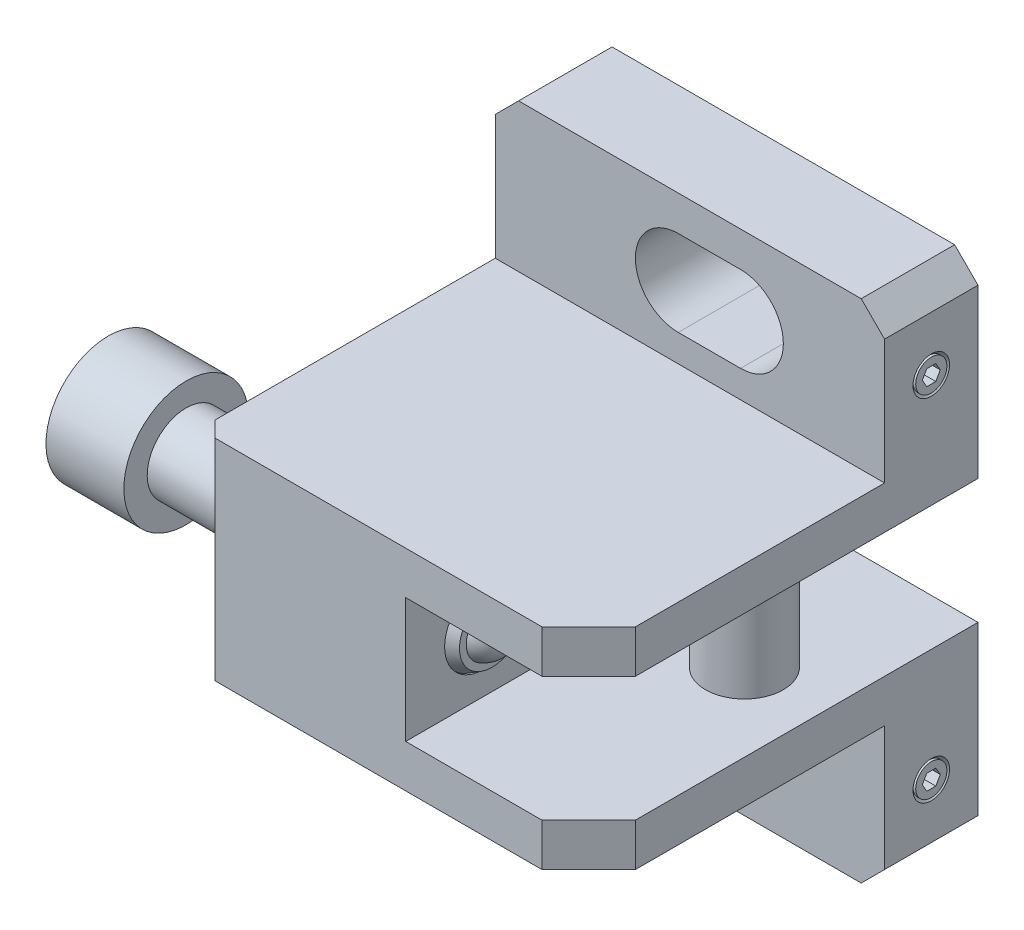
ISO-10303-21;
HEADER;
FILE_DESCRIPTION(('STEP AP214'),'2;1');
FILE_NAME('part.step','',(''),(''),'','','');
FILE_SCHEMA(('AUTOMOTIVE_DESIGN { 1 0 10303 214 1 1 1 1 }'));
ENDSEC;
DATA;
#1=APPLICATION_CONTEXT('core data for automotive mechanical design processes');
#2=APPLICATION_PROTOCOL_DEFINITION('international standard','automotive_design',2000,#1);
#3=PRODUCT_CONTEXT('',#1,'mechanical');
#4=PRODUCT('Part','Part','',(#3));
#5=PRODUCT_RELATED_PRODUCT_CATEGORY('part','',(#4));
#6=PRODUCT_DEFINITION_FORMATION('','',#4);
#7=PRODUCT_DEFINITION_CONTEXT('part definition',#1,'design');
#8=PRODUCT_DEFINITION('design','',#6,#7);
#9=PRODUCT_DEFINITION_SHAPE('','',#8);
#10=(LENGTH_UNIT() NAMED_UNIT(*) SI_UNIT(.MILLI.,.METRE.));
#11=(NAMED_UNIT(*) PLANE_ANGLE_UNIT() SI_UNIT($,.RADIAN.));
#12=(NAMED_UNIT(*) SI_UNIT($,.STERADIAN.) SOLID_ANGLE_UNIT());
#13=UNCERTAINTY_MEASURE_WITH_UNIT(LENGTH_MEASURE(1.E-05),#10,'distance_accuracy_value','');
#14=(GEOMETRIC_REPRESENTATION_CONTEXT(3) GLOBAL_UNCERTAINTY_ASSIGNED_CONTEXT((#13)) GLOBAL_UNIT_ASSIGNED_CONTEXT((#10,
#11,#12)) REPRESENTATION_CONTEXT('',''));
#15=CARTESIAN_POINT('',(0.,0.,0.));
#16=DIRECTION('',(0.,0.,1.));
#17=DIRECTION('',(1.,0.,0.));
#18=AXIS2_PLACEMENT_3D('',#15,#16,#17);
#19=CARTESIAN_POINT('',(-48.2,27.7508920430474,46.0355722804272));
#20=DIRECTION('',(-1.,0.,0.));
#21=DIRECTION('',(0.,-0.656361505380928,-0.754446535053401));
#22=AXIS2_PLACEMENT_3D('',#19,#20,#21);
#23=PLANE('',#22);
#24=DIRECTION('',(0.,-0.19120247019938,-0.981550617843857));
#25=VECTOR('',#24,1.);
#26=CARTESIAN_POINT('',(-48.2,26.8677656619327,41.5019841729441));
#27=LINE('',#26,#25);
#28=CARTESIAN_POINT('',(-48.2,26.8677656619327,41.5019841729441));
#29=VERTEX_POINT('',#28);
#30=CARTESIAN_POINT('',(-48.2,25.9846392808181,36.968396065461));
#31=VERTEX_POINT('',#30);
#32=EDGE_CURVE('E703',#29,#31,#27,.T.);
#33=ORIENTED_EDGE('',*,*,#32,.T.);
#34=DIRECTION('',(0.,0.945649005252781,0.325189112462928));
#35=VECTOR('',#34,1.);
#36=CARTESIAN_POINT('',(-48.2,21.6168736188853,35.4664118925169));
#37=LINE('',#36,#35);
#38=CARTESIAN_POINT('',(-48.2,21.6168736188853,35.4664118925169));
#39=VERTEX_POINT('',#38);
#40=EDGE_CURVE('E705',#39,#31,#37,.T.);
#41=ORIENTED_EDGE('',*,*,#40,.F.);
#42=DIRECTION('',(0.,0.754446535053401,-0.656361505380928));
#43=VECTOR('',#42,1.);
#44=CARTESIAN_POINT('',(-48.2,18.1322343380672,38.498015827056));
#45=LINE('',#44,#43);
#46=CARTESIAN_POINT('',(-48.2,18.1322343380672,38.498015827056));
#47=VERTEX_POINT('',#46);
#48=EDGE_CURVE('E708',#47,#39,#45,.T.);
#49=ORIENTED_EDGE('',*,*,#48,.F.);
#50=DIRECTION('',(0.,0.191202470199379,0.981550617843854));
#51=VECTOR('',#50,1.);
#52=CARTESIAN_POINT('',(-48.2,18.1322343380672,38.498015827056));
#53=LINE('',#52,#51);
#54=CARTESIAN_POINT('',(-48.2,19.0153607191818,43.0316039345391));
#55=VERTEX_POINT('',#54);
#56=EDGE_CURVE('E335',#47,#55,#53,.T.);
#57=ORIENTED_EDGE('',*,*,#56,.T.);
#58=DIRECTION('',(0.,-0.94564900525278,-0.325189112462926));
#59=VECTOR('',#58,1.);
#60=CARTESIAN_POINT('',(-48.2,23.3831263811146,44.5335881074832));
#61=LINE('',#60,#59);
#62=CARTESIAN_POINT('',(-48.2,23.3831263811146,44.5335881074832));
#63=VERTEX_POINT('',#62);
#64=EDGE_CURVE('E318',#63,#55,#61,.T.);
#65=ORIENTED_EDGE('',*,*,#64,.F.);
#66=DIRECTION('',(0.,0.754446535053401,-0.656361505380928));
#67=VECTOR('',#66,1.);
#68=CARTESIAN_POINT('',(-48.2,23.3831263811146,44.5335881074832));
#69=LINE('',#68,#67);
#70=EDGE_CURVE('E332',#63,#29,#69,.T.);
#71=ORIENTED_EDGE('',*,*,#70,.T.);
#72=EDGE_LOOP('',(#33,#41,#49,#57,#65,#71));
#73=FACE_BOUND('',#72,.T.);
#74=ADVANCED_FACE('F14',(#73),#23,.T.);
#75=CARTESIAN_POINT('',(-48.2,21.6168736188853,35.4664118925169));
#76=DIRECTION('',(0.,-0.325189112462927,0.945649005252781));
#77=DIRECTION('',(0.,-0.945649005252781,-0.325189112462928));
#78=AXIS2_PLACEMENT_3D('',#75,#76,#77);
#79=PLANE('',#78);
#80=ORIENTED_EDGE('',*,*,#40,.T.);
#81=DIRECTION('',(-1.,0.,0.));
#82=VECTOR('',#81,1.);
#83=CARTESIAN_POINT('',(-48.2,25.9846392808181,36.968396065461));
#84=LINE('',#83,#82);
#85=CARTESIAN_POINT('',(-53.2,25.9846392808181,36.968396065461));
#86=VERTEX_POINT('',#85);
#87=EDGE_CURVE('E339',#31,#86,#84,.T.);
#88=ORIENTED_EDGE('',*,*,#87,.T.);
#89=DIRECTION('',(0.,0.945649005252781,0.325189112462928));
#90=VECTOR('',#89,1.);
#91=CARTESIAN_POINT('',(-53.2,21.6168736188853,35.4664118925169));
#92=LINE('',#91,#90);
#93=CARTESIAN_POINT('',(-53.2,21.6168736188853,35.4664118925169));
#94=VERTEX_POINT('',#93);
#95=EDGE_CURVE('E689',#94,#86,#92,.T.);
#96=ORIENTED_EDGE('',*,*,#95,.F.);
#97=DIRECTION('',(-1.,0.,0.));
#98=VECTOR('',#97,1.);
#99=CARTESIAN_POINT('',(-48.2,21.6168736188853,35.4664118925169));
#100=LINE('',#99,#98);
#101=EDGE_CURVE('E289',#39,#94,#100,.T.);
#102=ORIENTED_EDGE('',*,*,#101,.F.);
#103=EDGE_LOOP('',(#80,#88,#96,#102));
#104=FACE_BOUND('',#103,.T.);
#105=ADVANCED_FACE('F718',(#104),#79,.T.);
#106=CARTESIAN_POINT('',(-48.2,18.1322343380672,38.498015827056));
#107=DIRECTION('',(0.,0.656361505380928,0.754446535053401));
#108=DIRECTION('',(-1.,0.,0.));
#109=AXIS2_PLACEMENT_3D('',#106,#107,#108);
#110=PLANE('',#109);
#111=ORIENTED_EDGE('',*,*,#101,.T.);
#112=DIRECTION('',(0.,0.754446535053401,-0.656361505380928));
#113=VECTOR('',#112,1.);
#114=CARTESIAN_POINT('',(-53.2,18.1322343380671,38.498015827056));
#115=LINE('',#114,#113);
#116=CARTESIAN_POINT('',(-53.2,18.1322343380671,38.498015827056));
#117=VERTEX_POINT('',#116);
#118=EDGE_CURVE('E692',#117,#94,#115,.T.);
#119=ORIENTED_EDGE('',*,*,#118,.F.);
#120=DIRECTION('',(-1.,0.,0.));
#121=VECTOR('',#120,1.);
#122=CARTESIAN_POINT('',(-48.2,18.1322343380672,38.498015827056));
#123=LINE('',#122,#121);
#124=EDGE_CURVE('E345',#47,#117,#123,.T.);
#125=ORIENTED_EDGE('',*,*,#124,.F.);
#126=ORIENTED_EDGE('',*,*,#48,.T.);
#127=EDGE_LOOP('',(#111,#119,#125,#126));
#128=FACE_BOUND('',#127,.T.);
#129=ADVANCED_FACE('F709',(#128),#110,.T.);
#130=CARTESIAN_POINT('',(-48.2,18.1322343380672,38.498015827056));
#131=DIRECTION('',(0.,-0.981550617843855,0.191202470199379));
#132=DIRECTION('',(0.,-0.191202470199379,-0.981550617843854));
#133=AXIS2_PLACEMENT_3D('',#130,#131,#132);
#134=PLANE('',#133);
#135=ORIENTED_EDGE('',*,*,#124,.T.);
#136=DIRECTION('',(0.,0.191202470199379,0.981550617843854));
#137=VECTOR('',#136,1.);
#138=CARTESIAN_POINT('',(-53.2,18.1322343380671,38.498015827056));
#139=LINE('',#138,#137);
#140=CARTESIAN_POINT('',(-53.2,19.0153607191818,43.0316039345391));
#141=VERTEX_POINT('',#140);
#142=EDGE_CURVE('E697',#117,#141,#139,.T.);
#143=ORIENTED_EDGE('',*,*,#142,.T.);
#144=DIRECTION('',(-1.,0.,0.));
#145=VECTOR('',#144,1.);
#146=CARTESIAN_POINT('',(-48.2,19.0153607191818,43.0316039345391));
#147=LINE('',#146,#145);
#148=EDGE_CURVE('E326',#55,#141,#147,.T.);
#149=ORIENTED_EDGE('',*,*,#148,.F.);
#150=ORIENTED_EDGE('',*,*,#56,.F.);
#151=EDGE_LOOP('',(#135,#143,#149,#150));
#152=FACE_BOUND('',#151,.T.);
#153=ADVANCED_FACE('F712',(#152),#134,.F.);
#154=CARTESIAN_POINT('',(-48.2,23.3831263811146,44.5335881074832));
#155=DIRECTION('',(0.,0.325189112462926,-0.945649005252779));
#156=DIRECTION('',(0.,0.94564900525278,0.325189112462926));
#157=AXIS2_PLACEMENT_3D('',#154,#155,#156);
#158=PLANE('',#157);
#159=ORIENTED_EDGE('',*,*,#148,.T.);
#160=DIRECTION('',(0.,-0.94564900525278,-0.325189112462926));
#161=VECTOR('',#160,1.);
#162=CARTESIAN_POINT('',(-53.2,23.3831263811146,44.5335881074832));
#163=LINE('',#162,#161);
#164=CARTESIAN_POINT('',(-53.2,23.3831263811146,44.5335881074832));
#165=VERTEX_POINT('',#164);
#166=EDGE_CURVE('E320',#165,#141,#163,.T.);
#167=ORIENTED_EDGE('',*,*,#166,.F.);
#168=DIRECTION('',(-1.,0.,0.));
#169=VECTOR('',#168,1.);
#170=CARTESIAN_POINT('',(-48.2,23.3831263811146,44.5335881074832));
#171=LINE('',#170,#169);
#172=EDGE_CURVE('E315',#63,#165,#171,.T.);
#173=ORIENTED_EDGE('',*,*,#172,.F.);
#174=ORIENTED_EDGE('',*,*,#64,.T.);
#175=EDGE_LOOP('',(#159,#167,#173,#174));
#176=FACE_BOUND('',#175,.T.);
#177=ADVANCED_FACE('F317',(#176),#158,.T.);
#178=CARTESIAN_POINT('',(-48.2,23.3831263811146,44.5335881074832));
#179=DIRECTION('',(0.,0.656361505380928,0.754446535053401));
#180=DIRECTION('',(-1.,0.,0.));
#181=AXIS2_PLACEMENT_3D('',#178,#179,#180);
#182=PLANE('',#181);
#183=ORIENTED_EDGE('',*,*,#172,.T.);
#184=DIRECTION('',(0.,0.754446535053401,-0.656361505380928));
#185=VECTOR('',#184,1.);
#186=CARTESIAN_POINT('',(-53.2,23.3831263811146,44.5335881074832));
#187=LINE('',#186,#185);
#188=CARTESIAN_POINT('',(-53.2,26.8677656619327,41.5019841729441));
#189=VERTEX_POINT('',#188);
#190=EDGE_CURVE('E701',#165,#189,#187,.T.);
#191=ORIENTED_EDGE('',*,*,#190,.T.);
#192=DIRECTION('',(-1.,0.,0.));
#193=VECTOR('',#192,1.);
#194=CARTESIAN_POINT('',(-48.2,26.8677656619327,41.5019841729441));
#195=LINE('',#194,#193);
#196=EDGE_CURVE('E325',#29,#189,#195,.T.);
#197=ORIENTED_EDGE('',*,*,#196,.F.);
#198=ORIENTED_EDGE('',*,*,#70,.F.);
#199=EDGE_LOOP('',(#183,#191,#197,#198));
#200=FACE_BOUND('',#199,.T.);
#201=ADVANCED_FACE('F337',(#200),#182,.F.);
#202=CARTESIAN_POINT('',(-48.2,26.8677656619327,41.5019841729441));
#203=DIRECTION('',(0.,0.981550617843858,-0.191202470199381));
#204=DIRECTION('',(0.,0.19120247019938,0.981550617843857));
#205=AXIS2_PLACEMENT_3D('',#202,#203,#204);
#206=PLANE('',#205);
#207=ORIENTED_EDGE('',*,*,#196,.T.);
#208=DIRECTION('',(0.,-0.19120247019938,-0.981550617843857));
#209=VECTOR('',#208,1.);
#210=CARTESIAN_POINT('',(-53.2,26.8677656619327,41.5019841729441));
#211=LINE('',#210,#209);
#212=EDGE_CURVE('E33',#189,#86,#211,.T.);
#213=ORIENTED_EDGE('',*,*,#212,.T.);
#214=ORIENTED_EDGE('',*,*,#87,.F.);
#215=ORIENTED_EDGE('',*,*,#32,.F.);
#216=EDGE_LOOP('',(#207,#213,#214,#215));
#217=FACE_BOUND('',#216,.T.);
#218=ADVANCED_FACE('F719',(#217),#206,.F.);
#219=CARTESIAN_POINT('',(-53.2,27.7508920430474,46.0355722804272));
#220=DIRECTION('',(-1.,0.,0.));
#221=DIRECTION('',(0.,-0.656361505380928,-0.754446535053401));
#222=AXIS2_PLACEMENT_3D('',#219,#220,#221);
#223=PLANE('',#222);
#224=ORIENTED_EDGE('',*,*,#212,.F.);
#225=ORIENTED_EDGE('',*,*,#190,.F.);
#226=ORIENTED_EDGE('',*,*,#166,.T.);
#227=ORIENTED_EDGE('',*,*,#142,.F.);
#228=ORIENTED_EDGE('',*,*,#118,.T.);
#229=ORIENTED_EDGE('',*,*,#95,.T.);
#230=EDGE_LOOP('',(#224,#225,#226,#227,#228,#229));
#231=FACE_BOUND('',#230,.T.);
#232=CARTESIAN_POINT('',(-53.2,22.5,40.));
#233=DIRECTION('',(1.,0.,0.));
#234=DIRECTION('',(0.,0.656361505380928,0.754446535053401));
#235=AXIS2_PLACEMENT_3D('',#232,#233,#234);
#236=CIRCLE('',#235,8.);
#237=CARTESIAN_POINT('',(-53.2,27.7508920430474,46.0355722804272));
#238=VERTEX_POINT('',#237);
#239=EDGE_CURVE('E349',#238,#238,#236,.T.);
#240=ORIENTED_EDGE('',*,*,#239,.F.);
#241=EDGE_LOOP('',(#240));
#242=FACE_BOUND('',#241,.T.);
#243=ADVANCED_FACE('F715',(#231,#242),#223,.T.);
#244=CARTESIAN_POINT('',(6.8,22.5,40.));
#245=DIRECTION('',(1.,0.,0.));
#246=DIRECTION('',(0.,0.656361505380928,0.754446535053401));
#247=AXIS2_PLACEMENT_3D('',#244,#245,#246);
#248=CYLINDRICAL_SURFACE('',#247,8.);
#249=ORIENTED_EDGE('',*,*,#239,.T.);
#250=EDGE_LOOP('',(#249));
#251=FACE_BOUND('',#250,.T.);
#252=CARTESIAN_POINT('',(-43.2,22.5,40.));
#253=DIRECTION('',(1.,0.,0.));
#254=DIRECTION('',(0.,0.656361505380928,0.754446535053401));
#255=AXIS2_PLACEMENT_3D('',#252,#253,#254);
#256=CIRCLE('',#255,8.);
#257=CARTESIAN_POINT('',(-43.2,27.7508920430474,46.0355722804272));
#258=VERTEX_POINT('',#257);
#259=EDGE_CURVE('E352',#258,#258,#256,.T.);
#260=ORIENTED_EDGE('',*,*,#259,.F.);
#261=EDGE_LOOP('',(#260));
#262=FACE_BOUND('',#261,.T.);
#263=ADVANCED_FACE('F728',(#251,#262),#248,.T.);
#264=CARTESIAN_POINT('',(-43.2,25.7818075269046,43.772232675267));
#265=DIRECTION('',(1.,0.,0.));
#266=DIRECTION('',(0.,0.656361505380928,0.754446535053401));
#267=AXIS2_PLACEMENT_3D('',#264,#265,#266);
#268=PLANE('',#267);
#269=ORIENTED_EDGE('',*,*,#259,.T.);
#270=EDGE_LOOP('',(#269));
#271=FACE_BOUND('',#270,.T.);
#272=CARTESIAN_POINT('',(-43.2,22.5,40.));
#273=DIRECTION('',(1.,0.,0.));
#274=DIRECTION('',(0.,0.656361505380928,0.754446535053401));
#275=AXIS2_PLACEMENT_3D('',#272,#273,#274);
#276=CIRCLE('',#275,5.);
#277=CARTESIAN_POINT('',(-43.2,25.7818075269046,43.772232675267));
#278=VERTEX_POINT('',#277);
#279=EDGE_CURVE('E355',#278,#278,#276,.T.);
#280=ORIENTED_EDGE('',*,*,#279,.F.);
#281=EDGE_LOOP('',(#280));
#282=FACE_BOUND('',#281,.T.);
#283=ADVANCED_FACE('F750',(#271,#282),#268,.T.);
#284=CARTESIAN_POINT('',(6.8,22.5,40.));
#285=DIRECTION('',(1.,0.,0.));
#286=DIRECTION('',(0.,0.656361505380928,0.754446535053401));
#287=AXIS2_PLACEMENT_3D('',#284,#285,#286);
#288=CYLINDRICAL_SURFACE('',#287,5.);
#289=ORIENTED_EDGE('',*,*,#279,.T.);
#290=EDGE_LOOP('',(#289));
#291=FACE_BOUND('',#290,.T.);
#292=CARTESIAN_POINT('',(-31.5,22.5,40.));
#293=DIRECTION('',(1.,0.,0.));
#294=DIRECTION('',(0.,0.,-1.));
#295=AXIS2_PLACEMENT_3D('',#292,#293,#294);
#296=CIRCLE('',#295,5.);
#297=CARTESIAN_POINT('',(-31.5,22.5,35.));
#298=VERTEX_POINT('',#297);
#299=EDGE_CURVE('E9',#298,#298,#296,.F.);
#300=ORIENTED_EDGE('',*,*,#299,.T.);
#301=EDGE_LOOP('',(#300));
#302=FACE_BOUND('',#301,.T.);
#303=ADVANCED_FACE('F754',(#291,#302),#288,.T.);
#304=CARTESIAN_POINT('',(-5.,22.5,40.));
#305=DIRECTION('',(1.,0.,0.));
#306=DIRECTION('',(0.,0.656361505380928,0.754446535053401));
#307=AXIS2_PLACEMENT_3D('',#304,#305,#306);
#308=SPHERICAL_SURFACE('',#307,3.5);
#309=CARTESIAN_POINT('',(-3.9,22.5,40.));
#310=DIRECTION('',(1.,0.,0.));
#311=DIRECTION('',(0.,0.656361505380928,0.754446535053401));
#312=AXIS2_PLACEMENT_3D('',#309,#310,#311);
#313=CIRCLE('',#312,3.32264954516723);
#314=CARTESIAN_POINT('',(-3.9,24.6808592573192,42.5067614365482));
#315=VERTEX_POINT('',#314);
#316=EDGE_CURVE('E24',#315,#315,#313,.T.);
#317=ORIENTED_EDGE('',*,*,#316,.T.);
#318=EDGE_LOOP('',(#317));
#319=FACE_BOUND('',#318,.T.);
#320=ADVANCED_FACE('F758',(#319),#308,.T.);
#321=CARTESIAN_POINT('',(-3.9,25.2512768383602,43.1624208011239));
#322=DIRECTION('',(-1.,0.,0.));
#323=DIRECTION('',(0.,-0.656361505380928,-0.754446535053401));
#324=AXIS2_PLACEMENT_3D('',#321,#322,#323);
#325=PLANE('',#324);
#326=ORIENTED_EDGE('',*,*,#316,.F.);
#327=EDGE_LOOP('',(#326));
#328=FACE_BOUND('',#327,.T.);
#329=CARTESIAN_POINT('',(-3.9,22.5,40.));
#330=DIRECTION('',(1.,0.,0.));
#331=DIRECTION('',(0.,0.656361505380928,0.754446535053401));
#332=AXIS2_PLACEMENT_3D('',#329,#330,#331);
#333=CIRCLE('',#332,4.19170962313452);
#334=CARTESIAN_POINT('',(-3.9,25.2512768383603,43.1624208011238));
#335=VERTEX_POINT('',#334);
#336=EDGE_CURVE('E361',#335,#335,#333,.T.);
#337=ORIENTED_EDGE('',*,*,#336,.T.);
#338=EDGE_LOOP('',(#337));
#339=FACE_BOUND('',#338,.T.);
#340=ADVANCED_FACE('F765',(#328,#339),#325,.F.);
#341=CARTESIAN_POINT('',(-5.3,22.5,40.));
#342=DIRECTION('',(-1.,0.,0.));
#343=DIRECTION('',(0.,-0.656361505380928,-0.754446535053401));
#344=AXIS2_PLACEMENT_3D('',#341,#342,#343);
#345=CONICAL_SURFACE('',#344,5.,0.523598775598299);
#346=ORIENTED_EDGE('',*,*,#336,.F.);
#347=EDGE_LOOP('',(#346));
#348=FACE_BOUND('',#347,.T.);
#349=CARTESIAN_POINT('',(-5.3,22.5,40.));
#350=DIRECTION('',(1.,0.,0.));
#351=DIRECTION('',(0.,0.656361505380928,0.754446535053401));
#352=AXIS2_PLACEMENT_3D('',#349,#350,#351);
#353=CIRCLE('',#352,5.);
#354=CARTESIAN_POINT('',(-5.3,25.7818075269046,43.772232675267));
#355=VERTEX_POINT('',#354);
#356=EDGE_CURVE('E358',#355,#355,#353,.T.);
#357=ORIENTED_EDGE('',*,*,#356,.T.);
#358=EDGE_LOOP('',(#357));
#359=FACE_BOUND('',#358,.T.);
#360=ADVANCED_FACE('F761',(#348,#359),#345,.T.);
#361=CARTESIAN_POINT('',(17.,-1.,7.73205080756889));
#362=DIRECTION('',(1.,0.,0.));
#363=DIRECTION('',(0.,1.,0.));
#364=AXIS2_PLACEMENT_3D('',#361,#362,#363);
#365=PLANE('',#364);
#366=DIRECTION('',(0.,-0.866025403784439,0.5));
#367=VECTOR('',#366,1.);
#368=CARTESIAN_POINT('',(17.,1.,6.57735026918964));
#369=LINE('',#368,#367);
#370=CARTESIAN_POINT('',(17.,1.,6.57735026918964));
#371=VERTEX_POINT('',#370);
#372=CARTESIAN_POINT('',(17.,0.,7.15470053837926));
#373=VERTEX_POINT('',#372);
#374=EDGE_CURVE('E389',#371,#373,#369,.T.);
#375=ORIENTED_EDGE('',*,*,#374,.T.);
#376=DIRECTION('',(0.,-0.866025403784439,-0.5));
#377=VECTOR('',#376,1.);
#378=CARTESIAN_POINT('',(17.,0.,7.15470053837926));
#379=LINE('',#378,#377);
#380=CARTESIAN_POINT('',(17.,-1.,6.57735026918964));
#381=VERTEX_POINT('',#380);
#382=EDGE_CURVE('E392',#373,#381,#379,.T.);
#383=ORIENTED_EDGE('',*,*,#382,.T.);
#384=DIRECTION('',(0.,0.,-1.));
#385=VECTOR('',#384,1.);
#386=CARTESIAN_POINT('',(17.,-1.,6.57735026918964));
#387=LINE('',#386,#385);
#388=CARTESIAN_POINT('',(17.,-1.,5.42264973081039));
#389=VERTEX_POINT('',#388);
#390=EDGE_CURVE('E395',#381,#389,#387,.T.);
#391=ORIENTED_EDGE('',*,*,#390,.T.);
#392=DIRECTION('',(0.,0.866025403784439,-0.5));
#393=VECTOR('',#392,1.);
#394=CARTESIAN_POINT('',(17.,-1.,5.42264973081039));
#395=LINE('',#394,#393);
#396=CARTESIAN_POINT('',(17.,0.,4.84529946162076));
#397=VERTEX_POINT('',#396);
#398=EDGE_CURVE('E398',#389,#397,#395,.T.);
#399=ORIENTED_EDGE('',*,*,#398,.T.);
#400=DIRECTION('',(0.,0.866025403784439,0.5));
#401=VECTOR('',#400,1.);
#402=CARTESIAN_POINT('',(17.,0.,4.84529946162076));
#403=LINE('',#402,#401);
#404=CARTESIAN_POINT('',(17.,1.,5.42264973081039));
#405=VERTEX_POINT('',#404);
#406=EDGE_CURVE('E401',#397,#405,#403,.T.);
#407=ORIENTED_EDGE('',*,*,#406,.T.);
#408=DIRECTION('',(0.,0.,1.));
#409=VECTOR('',#408,1.);
#410=CARTESIAN_POINT('',(17.,1.,5.42264973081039));
#411=LINE('',#410,#409);
#412=EDGE_CURVE('E404',#405,#371,#411,.T.);
#413=ORIENTED_EDGE('',*,*,#412,.T.);
#414=EDGE_LOOP('',(#375,#383,#391,#399,#407,#413));
#415=FACE_BOUND('',#414,.T.);
#416=ADVANCED_FACE('F764',(#415),#365,.T.);
#417=CARTESIAN_POINT('',(17.,44.,7.73205080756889));
#418=DIRECTION('',(1.,0.,0.));
#419=DIRECTION('',(0.,1.,0.));
#420=AXIS2_PLACEMENT_3D('',#417,#418,#419);
#421=PLANE('',#420);
#422=DIRECTION('',(0.,-0.866025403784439,0.5));
#423=VECTOR('',#422,1.);
#424=CARTESIAN_POINT('',(17.,46.,6.57735026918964));
#425=LINE('',#424,#423);
#426=CARTESIAN_POINT('',(17.,46.,6.57735026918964));
#427=VERTEX_POINT('',#426);
#428=CARTESIAN_POINT('',(17.,45.,7.15470053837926));
#429=VERTEX_POINT('',#428);
#430=EDGE_CURVE('E440',#427,#429,#425,.T.);
#431=ORIENTED_EDGE('',*,*,#430,.T.);
#432=DIRECTION('',(0.,-0.866025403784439,-0.5));
#433=VECTOR('',#432,1.);
#434=CARTESIAN_POINT('',(17.,45.,7.15470053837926));
#435=LINE('',#434,#433);
#436=CARTESIAN_POINT('',(17.,44.,6.57735026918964));
#437=VERTEX_POINT('',#436);
#438=EDGE_CURVE('E443',#429,#437,#435,.T.);
#439=ORIENTED_EDGE('',*,*,#438,.T.);
#440=DIRECTION('',(0.,0.,-1.));
#441=VECTOR('',#440,1.);
#442=CARTESIAN_POINT('',(17.,44.,6.57735026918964));
#443=LINE('',#442,#441);
#444=CARTESIAN_POINT('',(17.,44.,5.42264973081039));
#445=VERTEX_POINT('',#444);
#446=EDGE_CURVE('E446',#437,#445,#443,.T.);
#447=ORIENTED_EDGE('',*,*,#446,.T.);
#448=DIRECTION('',(0.,0.866025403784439,-0.5));
#449=VECTOR('',#448,1.);
#450=CARTESIAN_POINT('',(17.,44.,5.42264973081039));
#451=LINE('',#450,#449);
#452=CARTESIAN_POINT('',(17.,45.,4.84529946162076));
#453=VERTEX_POINT('',#452);
#454=EDGE_CURVE('E449',#445,#453,#451,.T.);
#455=ORIENTED_EDGE('',*,*,#454,.T.);
#456=DIRECTION('',(0.,0.866025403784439,0.5));
#457=VECTOR('',#456,1.);
#458=CARTESIAN_POINT('',(17.,45.,4.84529946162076));
#459=LINE('',#458,#457);
#460=CARTESIAN_POINT('',(17.,46.,5.42264973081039));
#461=VERTEX_POINT('',#460);
#462=EDGE_CURVE('E452',#453,#461,#459,.T.);
#463=ORIENTED_EDGE('',*,*,#462,.T.);
#464=DIRECTION('',(0.,0.,1.));
#465=VECTOR('',#464,1.);
#466=CARTESIAN_POINT('',(17.,46.,5.42264973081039));
#467=LINE('',#466,#465);
#468=EDGE_CURVE('E455',#461,#427,#467,.T.);
#469=ORIENTED_EDGE('',*,*,#468,.T.);
#470=EDGE_LOOP('',(#431,#439,#447,#455,#463,#469));
#471=FACE_BOUND('',#470,.T.);
#472=ADVANCED_FACE('F779',(#471),#421,.T.);
#473=CARTESIAN_POINT('',(17.,0.,7.15470053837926));
#474=DIRECTION('',(0.,-0.5,0.866025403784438));
#475=DIRECTION('',(0.,-0.866025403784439,-0.5));
#476=AXIS2_PLACEMENT_3D('',#473,#474,#475);
#477=PLANE('',#476);
#478=DIRECTION('',(0.,-0.866025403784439,-0.5));
#479=VECTOR('',#478,1.);
#480=CARTESIAN_POINT('',(18.5,0.,7.15470053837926));
#481=LINE('',#480,#479);
#482=CARTESIAN_POINT('',(18.5,0.,7.15470053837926));
#483=VERTEX_POINT('',#482);
#484=CARTESIAN_POINT('',(18.5,-1.,6.57735026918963));
#485=VERTEX_POINT('',#484);
#486=EDGE_CURVE('E374',#483,#485,#481,.T.);
#487=ORIENTED_EDGE('',*,*,#486,.T.);
#488=DIRECTION('',(1.,0.,0.));
#489=VECTOR('',#488,1.);
#490=CARTESIAN_POINT('',(17.,-1.,6.57735026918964));
#491=LINE('',#490,#489);
#492=EDGE_CURVE('E417',#381,#485,#491,.T.);
#493=ORIENTED_EDGE('',*,*,#492,.F.);
#494=ORIENTED_EDGE('',*,*,#382,.F.);
#495=DIRECTION('',(1.,0.,0.));
#496=VECTOR('',#495,1.);
#497=CARTESIAN_POINT('',(17.,0.,7.15470053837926));
#498=LINE('',#497,#496);
#499=EDGE_CURVE('E407',#373,#483,#498,.T.);
#500=ORIENTED_EDGE('',*,*,#499,.T.);
#501=EDGE_LOOP('',(#487,#493,#494,#500));
#502=FACE_BOUND('',#501,.T.);
#503=ADVANCED_FACE('F784',(#502),#477,.F.);
#504=CARTESIAN_POINT('',(17.,-1.,6.57735026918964));
#505=DIRECTION('',(0.,-1.,0.));
#506=DIRECTION('',(0.,0.,-1.));
#507=AXIS2_PLACEMENT_3D('',#504,#505,#506);
#508=PLANE('',#507);
#509=DIRECTION('',(0.,0.,-1.));
#510=VECTOR('',#509,1.);
#511=CARTESIAN_POINT('',(18.5,-1.,6.57735026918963));
#512=LINE('',#511,#510);
#513=CARTESIAN_POINT('',(18.5,-1.,5.42264973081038));
#514=VERTEX_POINT('',#513);
#515=EDGE_CURVE('E377',#485,#514,#512,.T.);
#516=ORIENTED_EDGE('',*,*,#515,.T.);
#517=DIRECTION('',(1.,0.,0.));
#518=VECTOR('',#517,1.);
#519=CARTESIAN_POINT('',(17.,-1.,5.42264973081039));
#520=LINE('',#519,#518);
#521=EDGE_CURVE('E415',#389,#514,#520,.T.);
#522=ORIENTED_EDGE('',*,*,#521,.F.);
#523=ORIENTED_EDGE('',*,*,#390,.F.);
#524=ORIENTED_EDGE('',*,*,#492,.T.);
#525=EDGE_LOOP('',(#516,#522,#523,#524));
#526=FACE_BOUND('',#525,.T.);
#527=ADVANCED_FACE('F797',(#526),#508,.F.);
#528=CARTESIAN_POINT('',(17.,-1.,5.42264973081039));
#529=DIRECTION('',(0.,-0.5,-0.866025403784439));
#530=DIRECTION('',(0.,0.866025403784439,-0.5));
#531=AXIS2_PLACEMENT_3D('',#528,#529,#530);
#532=PLANE('',#531);
#533=DIRECTION('',(0.,0.866025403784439,-0.5));
#534=VECTOR('',#533,1.);
#535=CARTESIAN_POINT('',(18.5,-1.,5.42264973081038));
#536=LINE('',#535,#534);
#537=CARTESIAN_POINT('',(18.5,0.,4.84529946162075));
#538=VERTEX_POINT('',#537);
#539=EDGE_CURVE('E380',#514,#538,#536,.T.);
#540=ORIENTED_EDGE('',*,*,#539,.T.);
#541=DIRECTION('',(1.,0.,0.));
#542=VECTOR('',#541,1.);
#543=CARTESIAN_POINT('',(17.,0.,4.84529946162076));
#544=LINE('',#543,#542);
#545=EDGE_CURVE('E413',#397,#538,#544,.T.);
#546=ORIENTED_EDGE('',*,*,#545,.F.);
#547=ORIENTED_EDGE('',*,*,#398,.F.);
#548=ORIENTED_EDGE('',*,*,#521,.T.);
#549=EDGE_LOOP('',(#540,#546,#547,#548));
#550=FACE_BOUND('',#549,.T.);
#551=ADVANCED_FACE('F793',(#550),#532,.F.);
#552=CARTESIAN_POINT('',(17.,0.,4.84529946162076));
#553=DIRECTION('',(0.,0.5,-0.866025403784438));
#554=DIRECTION('',(0.,0.866025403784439,0.5));
#555=AXIS2_PLACEMENT_3D('',#552,#553,#554);
#556=PLANE('',#555);
#557=DIRECTION('',(0.,0.866025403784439,0.5));
#558=VECTOR('',#557,1.);
#559=CARTESIAN_POINT('',(18.5,0.,4.84529946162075));
#560=LINE('',#559,#558);
#561=CARTESIAN_POINT('',(18.5,1.,5.42264973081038));
#562=VERTEX_POINT('',#561);
#563=EDGE_CURVE('E383',#538,#562,#560,.T.);
#564=ORIENTED_EDGE('',*,*,#563,.T.);
#565=DIRECTION('',(1.,0.,0.));
#566=VECTOR('',#565,1.);
#567=CARTESIAN_POINT('',(17.,1.,5.42264973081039));
#568=LINE('',#567,#566);
#569=EDGE_CURVE('E411',#405,#562,#568,.T.);
#570=ORIENTED_EDGE('',*,*,#569,.F.);
#571=ORIENTED_EDGE('',*,*,#406,.F.);
#572=ORIENTED_EDGE('',*,*,#545,.T.);
#573=EDGE_LOOP('',(#564,#570,#571,#572));
#574=FACE_BOUND('',#573,.T.);
#575=ADVANCED_FACE('F789',(#574),#556,.F.);
#576=CARTESIAN_POINT('',(17.,1.,5.42264973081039));
#577=DIRECTION('',(0.,1.,0.));
#578=DIRECTION('',(0.,0.,1.));
#579=AXIS2_PLACEMENT_3D('',#576,#577,#578);
#580=PLANE('',#579);
#581=DIRECTION('',(0.,0.,1.));
#582=VECTOR('',#581,1.);
#583=CARTESIAN_POINT('',(18.5,1.,5.42264973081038));
#584=LINE('',#583,#582);
#585=CARTESIAN_POINT('',(18.5,1.,6.57735026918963));
#586=VERTEX_POINT('',#585);
#587=EDGE_CURVE('E386',#562,#586,#584,.T.);
#588=ORIENTED_EDGE('',*,*,#587,.T.);
#589=DIRECTION('',(1.,0.,0.));
#590=VECTOR('',#589,1.);
#591=CARTESIAN_POINT('',(17.,1.,6.57735026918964));
#592=LINE('',#591,#590);
#593=EDGE_CURVE('E408',#371,#586,#592,.T.);
#594=ORIENTED_EDGE('',*,*,#593,.F.);
#595=ORIENTED_EDGE('',*,*,#412,.F.);
#596=ORIENTED_EDGE('',*,*,#569,.T.);
#597=EDGE_LOOP('',(#588,#594,#595,#596));
#598=FACE_BOUND('',#597,.T.);
#599=ADVANCED_FACE('F785',(#598),#580,.F.);
#600=CARTESIAN_POINT('',(17.,1.,6.57735026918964));
#601=DIRECTION('',(0.,0.5,0.866025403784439));
#602=DIRECTION('',(0.,-0.866025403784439,0.5));
#603=AXIS2_PLACEMENT_3D('',#600,#601,#602);
#604=PLANE('',#603);
#605=DIRECTION('',(0.,-0.866025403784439,0.5));
#606=VECTOR('',#605,1.);
#607=CARTESIAN_POINT('',(18.5,1.,6.57735026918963));
#608=LINE('',#607,#606);
#609=EDGE_CURVE('E372',#586,#483,#608,.T.);
#610=ORIENTED_EDGE('',*,*,#609,.T.);
#611=ORIENTED_EDGE('',*,*,#499,.F.);
#612=ORIENTED_EDGE('',*,*,#374,.F.);
#613=ORIENTED_EDGE('',*,*,#593,.T.);
#614=EDGE_LOOP('',(#610,#611,#612,#613));
#615=FACE_BOUND('',#614,.T.);
#616=ADVANCED_FACE('F788',(#615),#604,.F.);
#617=CARTESIAN_POINT('',(17.,45.,7.15470053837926));
#618=DIRECTION('',(0.,-0.5,0.866025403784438));
#619=DIRECTION('',(0.,-0.866025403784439,-0.5));
#620=AXIS2_PLACEMENT_3D('',#617,#618,#619);
#621=PLANE('',#620);
#622=DIRECTION('',(0.,-0.866025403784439,-0.5));
#623=VECTOR('',#622,1.);
#624=CARTESIAN_POINT('',(18.5,45.,7.15470053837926));
#625=LINE('',#624,#623);
#626=CARTESIAN_POINT('',(18.5,45.,7.15470053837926));
#627=VERTEX_POINT('',#626);
#628=CARTESIAN_POINT('',(18.5,44.,6.57735026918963));
#629=VERTEX_POINT('',#628);
#630=EDGE_CURVE('E425',#627,#629,#625,.T.);
#631=ORIENTED_EDGE('',*,*,#630,.T.);
#632=DIRECTION('',(1.,0.,0.));
#633=VECTOR('',#632,1.);
#634=CARTESIAN_POINT('',(17.,44.,6.57735026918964));
#635=LINE('',#634,#633);
#636=EDGE_CURVE('E468',#437,#629,#635,.T.);
#637=ORIENTED_EDGE('',*,*,#636,.F.);
#638=ORIENTED_EDGE('',*,*,#438,.F.);
#639=DIRECTION('',(1.,0.,0.));
#640=VECTOR('',#639,1.);
#641=CARTESIAN_POINT('',(17.,45.,7.15470053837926));
#642=LINE('',#641,#640);
#643=EDGE_CURVE('E458',#429,#627,#642,.T.);
#644=ORIENTED_EDGE('',*,*,#643,.T.);
#645=EDGE_LOOP('',(#631,#637,#638,#644));
#646=FACE_BOUND('',#645,.T.);
#647=ADVANCED_FACE('F807',(#646),#621,.F.);
#648=CARTESIAN_POINT('',(17.,44.,6.57735026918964));
#649=DIRECTION('',(0.,-1.,0.));
#650=DIRECTION('',(0.,0.,-1.));
#651=AXIS2_PLACEMENT_3D('',#648,#649,#650);
#652=PLANE('',#651);
#653=DIRECTION('',(0.,0.,-1.));
#654=VECTOR('',#653,1.);
#655=CARTESIAN_POINT('',(18.5,44.,6.57735026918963));
#656=LINE('',#655,#654);
#657=CARTESIAN_POINT('',(18.5,44.,5.42264973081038));
#658=VERTEX_POINT('',#657);
#659=EDGE_CURVE('E428',#629,#658,#656,.T.);
#660=ORIENTED_EDGE('',*,*,#659,.T.);
#661=DIRECTION('',(1.,0.,0.));
#662=VECTOR('',#661,1.);
#663=CARTESIAN_POINT('',(17.,44.,5.42264973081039));
#664=LINE('',#663,#662);
#665=EDGE_CURVE('E466',#445,#658,#664,.T.);
#666=ORIENTED_EDGE('',*,*,#665,.F.);
#667=ORIENTED_EDGE('',*,*,#446,.F.);
#668=ORIENTED_EDGE('',*,*,#636,.T.);
#669=EDGE_LOOP('',(#660,#666,#667,#668));
#670=FACE_BOUND('',#669,.T.);
#671=ADVANCED_FACE('F834',(#670),#652,.F.);
#672=CARTESIAN_POINT('',(17.,44.,5.42264973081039));
#673=DIRECTION('',(0.,-0.5,-0.866025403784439));
#674=DIRECTION('',(0.,0.866025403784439,-0.5));
#675=AXIS2_PLACEMENT_3D('',#672,#673,#674);
#676=PLANE('',#675);
#677=DIRECTION('',(0.,0.866025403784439,-0.5));
#678=VECTOR('',#677,1.);
#679=CARTESIAN_POINT('',(18.5,44.,5.42264973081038));
#680=LINE('',#679,#678);
#681=CARTESIAN_POINT('',(18.5,45.,4.84529946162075));
#682=VERTEX_POINT('',#681);
#683=EDGE_CURVE('E431',#658,#682,#680,.T.);
#684=ORIENTED_EDGE('',*,*,#683,.T.);
#685=DIRECTION('',(1.,0.,0.));
#686=VECTOR('',#685,1.);
#687=CARTESIAN_POINT('',(17.,45.,4.84529946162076));
#688=LINE('',#687,#686);
#689=EDGE_CURVE('E464',#453,#682,#688,.T.);
#690=ORIENTED_EDGE('',*,*,#689,.F.);
#691=ORIENTED_EDGE('',*,*,#454,.F.);
#692=ORIENTED_EDGE('',*,*,#665,.T.);
#693=EDGE_LOOP('',(#684,#690,#691,#692));
#694=FACE_BOUND('',#693,.T.);
#695=ADVANCED_FACE('F830',(#694),#676,.F.);
#696=CARTESIAN_POINT('',(17.,45.,4.84529946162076));
#697=DIRECTION('',(0.,0.5,-0.866025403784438));
#698=DIRECTION('',(0.,0.866025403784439,0.5));
#699=AXIS2_PLACEMENT_3D('',#696,#697,#698);
#700=PLANE('',#699);
#701=DIRECTION('',(0.,0.866025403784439,0.5));
#702=VECTOR('',#701,1.);
#703=CARTESIAN_POINT('',(18.5,45.,4.84529946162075));
#704=LINE('',#703,#702);
#705=CARTESIAN_POINT('',(18.5,46.,5.42264973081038));
#706=VERTEX_POINT('',#705);
#707=EDGE_CURVE('E434',#682,#706,#704,.T.);
#708=ORIENTED_EDGE('',*,*,#707,.T.);
#709=DIRECTION('',(1.,0.,0.));
#710=VECTOR('',#709,1.);
#711=CARTESIAN_POINT('',(17.,46.,5.42264973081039));
#712=LINE('',#711,#710);
#713=EDGE_CURVE('E462',#461,#706,#712,.T.);
#714=ORIENTED_EDGE('',*,*,#713,.F.);
#715=ORIENTED_EDGE('',*,*,#462,.F.);
#716=ORIENTED_EDGE('',*,*,#689,.T.);
#717=EDGE_LOOP('',(#708,#714,#715,#716));
#718=FACE_BOUND('',#717,.T.);
#719=ADVANCED_FACE('F826',(#718),#700,.F.);
#720=CARTESIAN_POINT('',(17.,46.,5.42264973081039));
#721=DIRECTION('',(0.,1.,0.));
#722=DIRECTION('',(0.,0.,1.));
#723=AXIS2_PLACEMENT_3D('',#720,#721,#722);
#724=PLANE('',#723);
#725=DIRECTION('',(0.,0.,1.));
#726=VECTOR('',#725,1.);
#727=CARTESIAN_POINT('',(18.5,46.,5.42264973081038));
#728=LINE('',#727,#726);
#729=CARTESIAN_POINT('',(18.5,46.,6.57735026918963));
#730=VERTEX_POINT('',#729);
#731=EDGE_CURVE('E437',#706,#730,#728,.T.);
#732=ORIENTED_EDGE('',*,*,#731,.T.);
#733=DIRECTION('',(1.,0.,0.));
#734=VECTOR('',#733,1.);
#735=CARTESIAN_POINT('',(17.,46.,6.57735026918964));
#736=LINE('',#735,#734);
#737=EDGE_CURVE('E459',#427,#730,#736,.T.);
#738=ORIENTED_EDGE('',*,*,#737,.F.);
#739=ORIENTED_EDGE('',*,*,#468,.F.);
#740=ORIENTED_EDGE('',*,*,#713,.T.);
#741=EDGE_LOOP('',(#732,#738,#739,#740));
#742=FACE_BOUND('',#741,.T.);
#743=ADVANCED_FACE('F823',(#742),#724,.F.);
#744=CARTESIAN_POINT('',(17.,46.,6.57735026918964));
#745=DIRECTION('',(0.,0.5,0.866025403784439));
#746=DIRECTION('',(0.,-0.866025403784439,0.5));
#747=AXIS2_PLACEMENT_3D('',#744,#745,#746);
#748=PLANE('',#747);
#749=DIRECTION('',(0.,-0.866025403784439,0.5));
#750=VECTOR('',#749,1.);
#751=CARTESIAN_POINT('',(18.5,46.,6.57735026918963));
#752=LINE('',#751,#750);
#753=EDGE_CURVE('E423',#730,#627,#752,.T.);
#754=ORIENTED_EDGE('',*,*,#753,.T.);
#755=ORIENTED_EDGE('',*,*,#643,.F.);
#756=ORIENTED_EDGE('',*,*,#430,.F.);
#757=ORIENTED_EDGE('',*,*,#737,.T.);
#758=EDGE_LOOP('',(#754,#755,#756,#757));
#759=FACE_BOUND('',#758,.T.);
#760=ADVANCED_FACE('F813',(#759),#748,.F.);
#761=CARTESIAN_POINT('',(18.5,0.,6.));
#762=DIRECTION('',(1.,0.,0.));
#763=DIRECTION('',(0.,1.,0.));
#764=AXIS2_PLACEMENT_3D('',#761,#762,#763);
#765=PLANE('',#764);
#766=ORIENTED_EDGE('',*,*,#609,.F.);
#767=ORIENTED_EDGE('',*,*,#587,.F.);
#768=ORIENTED_EDGE('',*,*,#563,.F.);
#769=ORIENTED_EDGE('',*,*,#539,.F.);
#770=ORIENTED_EDGE('',*,*,#515,.F.);
#771=ORIENTED_EDGE('',*,*,#486,.F.);
#772=EDGE_LOOP('',(#766,#767,#768,#769,#770,#771));
#773=FACE_BOUND('',#772,.T.);
#774=CARTESIAN_POINT('',(18.5,0.,6.));
#775=DIRECTION('',(1.,0.,0.));
#776=DIRECTION('',(0.,1.,0.));
#777=AXIS2_PLACEMENT_3D('',#774,#775,#776);
#778=CIRCLE('',#777,2.);
#779=CARTESIAN_POINT('',(18.5,2.,6.));
#780=VERTEX_POINT('',#779);
#781=EDGE_CURVE('E410',#780,#780,#778,.T.);
#782=ORIENTED_EDGE('',*,*,#781,.T.);
#783=EDGE_LOOP('',(#782));
#784=FACE_BOUND('',#783,.T.);
#785=ADVANCED_FACE('F809',(#773,#784),#765,.T.);
#786=CARTESIAN_POINT('',(18.5,45.,6.));
#787=DIRECTION('',(1.,0.,0.));
#788=DIRECTION('',(0.,1.,0.));
#789=AXIS2_PLACEMENT_3D('',#786,#787,#788);
#790=PLANE('',#789);
#791=ORIENTED_EDGE('',*,*,#753,.F.);
#792=ORIENTED_EDGE('',*,*,#731,.F.);
#793=ORIENTED_EDGE('',*,*,#707,.F.);
#794=ORIENTED_EDGE('',*,*,#683,.F.);
#795=ORIENTED_EDGE('',*,*,#659,.F.);
#796=ORIENTED_EDGE('',*,*,#630,.F.);
#797=EDGE_LOOP('',(#791,#792,#793,#794,#795,#796));
#798=FACE_BOUND('',#797,.T.);
#799=CARTESIAN_POINT('',(18.5,45.,6.));
#800=DIRECTION('',(1.,0.,0.));
#801=DIRECTION('',(0.,1.,0.));
#802=AXIS2_PLACEMENT_3D('',#799,#800,#801);
#803=CIRCLE('',#802,2.);
#804=CARTESIAN_POINT('',(18.5,47.,6.));
#805=VERTEX_POINT('',#804);
#806=EDGE_CURVE('E461',#805,#805,#803,.T.);
#807=ORIENTED_EDGE('',*,*,#806,.T.);
#808=EDGE_LOOP('',(#807));
#809=FACE_BOUND('',#808,.T.);
#810=ADVANCED_FACE('F812',(#798,#809),#790,.T.);
#811=CARTESIAN_POINT('',(18.5,0.,6.));
#812=DIRECTION('',(-1.,0.,0.));
#813=DIRECTION('',(0.,-1.,0.));
#814=AXIS2_PLACEMENT_3D('',#811,#812,#813);
#815=CYLINDRICAL_SURFACE('',#814,2.);
#816=ORIENTED_EDGE('',*,*,#781,.F.);
#817=EDGE_LOOP('',(#816));
#818=FACE_BOUND('',#817,.T.);
#819=CARTESIAN_POINT('',(18.15,0.,6.));
#820=DIRECTION('',(1.,0.,0.));
#821=DIRECTION('',(0.,0.,-1.));
#822=AXIS2_PLACEMENT_3D('',#819,#820,#821);
#823=CIRCLE('',#822,2.);
#824=CARTESIAN_POINT('',(18.15,0.,4.));
#825=VERTEX_POINT('',#824);
#826=EDGE_CURVE('E682',#825,#825,#823,.T.);
#827=ORIENTED_EDGE('',*,*,#826,.T.);
#828=EDGE_LOOP('',(#827));
#829=FACE_BOUND('',#828,.T.);
#830=ADVANCED_FACE('F815',(#818,#829),#815,.T.);
#831=CARTESIAN_POINT('',(18.5,45.,6.));
#832=DIRECTION('',(-1.,0.,0.));
#833=DIRECTION('',(0.,-1.,0.));
#834=AXIS2_PLACEMENT_3D('',#831,#832,#833);
#835=CYLINDRICAL_SURFACE('',#834,2.);
#836=ORIENTED_EDGE('',*,*,#806,.F.);
#837=EDGE_LOOP('',(#836));
#838=FACE_BOUND('',#837,.T.);
#839=CARTESIAN_POINT('',(18.15,45.,6.));
#840=DIRECTION('',(1.,0.,0.));
#841=DIRECTION('',(0.,0.,-1.));
#842=AXIS2_PLACEMENT_3D('',#839,#840,#841);
#843=CIRCLE('',#842,2.);
#844=CARTESIAN_POINT('',(18.15,45.,4.));
#845=VERTEX_POINT('',#844);
#846=EDGE_CURVE('E18',#845,#845,#843,.T.);
#847=ORIENTED_EDGE('',*,*,#846,.T.);
#848=EDGE_LOOP('',(#847));
#849=FACE_BOUND('',#848,.T.);
#850=ADVANCED_FACE('F783',(#838,#849),#835,.T.);
#851=CARTESIAN_POINT('',(18.5,0.,6.));
#852=DIRECTION('',(1.,0.,0.));
#853=DIRECTION('',(0.,1.,0.));
#854=AXIS2_PLACEMENT_3D('',#851,#852,#853);
#855=CONICAL_SURFACE('',#854,2.35,0.785398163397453);
#856=CARTESIAN_POINT('',(18.5,0.,6.));
#857=DIRECTION('',(1.,0.,0.));
#858=DIRECTION('',(0.,1.,0.));
#859=AXIS2_PLACEMENT_3D('',#856,#857,#858);
#860=CIRCLE('',#859,2.35);
#861=CARTESIAN_POINT('',(18.5,2.35,6.));
#862=VERTEX_POINT('',#861);
#863=EDGE_CURVE('E474',#862,#862,#860,.T.);
#864=ORIENTED_EDGE('',*,*,#863,.T.);
#865=EDGE_LOOP('',(#864));
#866=FACE_BOUND('',#865,.T.);
#867=ORIENTED_EDGE('',*,*,#826,.F.);
#868=EDGE_LOOP('',(#867));
#869=FACE_BOUND('',#868,.T.);
#870=ADVANCED_FACE('F777',(#866,#869),#855,.F.);
#871=CARTESIAN_POINT('',(8.5,36.,20.));
#872=DIRECTION('',(0.,1.,0.));
#873=DIRECTION('',(-0.997354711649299,0.,-0.0726882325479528));
#874=AXIS2_PLACEMENT_3D('',#871,#872,#873);
#875=CYLINDRICAL_SURFACE('',#874,5.);
#876=CARTESIAN_POINT('',(8.5,14.5,20.));
#877=DIRECTION('',(0.,-1.,0.));
#878=DIRECTION('',(0.,0.,-1.));
#879=AXIS2_PLACEMENT_3D('',#876,#877,#878);
#880=CIRCLE('',#879,5.);
#881=CARTESIAN_POINT('',(8.5,14.5,15.));
#882=VERTEX_POINT('',#881);
#883=EDGE_CURVE('E366',#882,#882,#880,.F.);
#884=ORIENTED_EDGE('',*,*,#883,.T.);
#885=EDGE_LOOP('',(#884));
#886=FACE_BOUND('',#885,.T.);
#887=CARTESIAN_POINT('',(8.5,30.5,20.));
#888=DIRECTION('',(0.,1.,0.));
#889=DIRECTION('',(-1.,0.,0.));
#890=AXIS2_PLACEMENT_3D('',#887,#888,#889);
#891=CIRCLE('',#890,5.);
#892=CARTESIAN_POINT('',(3.5,30.5,20.));
#893=VERTEX_POINT('',#892);
#894=EDGE_CURVE('E369',#893,#893,#891,.F.);
#895=ORIENTED_EDGE('',*,*,#894,.T.);
#896=EDGE_LOOP('',(#895));
#897=FACE_BOUND('',#896,.T.);
#898=ADVANCED_FACE('F773',(#886,#897),#875,.T.);
#899=CARTESIAN_POINT('',(18.5,45.,6.));
#900=DIRECTION('',(1.,0.,0.));
#901=DIRECTION('',(0.,1.,0.));
#902=AXIS2_PLACEMENT_3D('',#899,#900,#901);
#903=CONICAL_SURFACE('',#902,2.35,0.785398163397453);
#904=CARTESIAN_POINT('',(18.5,45.,6.));
#905=DIRECTION('',(1.,0.,0.));
#906=DIRECTION('',(0.,1.,0.));
#907=AXIS2_PLACEMENT_3D('',#904,#905,#906);
#908=CIRCLE('',#907,2.35);
#909=CARTESIAN_POINT('',(18.5,47.35,6.));
#910=VERTEX_POINT('',#909);
#911=EDGE_CURVE('E477',#910,#910,#908,.T.);
#912=ORIENTED_EDGE('',*,*,#911,.T.);
#913=EDGE_LOOP('',(#912));
#914=FACE_BOUND('',#913,.T.);
#915=ORIENTED_EDGE('',*,*,#846,.F.);
#916=EDGE_LOOP('',(#915));
#917=FACE_BOUND('',#916,.T.);
#918=ADVANCED_FACE('F776',(#914,#917),#903,.F.);
#919=CARTESIAN_POINT('',(18.5,36.,44.));
#920=DIRECTION('',(-0.707106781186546,0.,-0.707106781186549));
#921=DIRECTION('',(-0.707106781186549,0.,0.707106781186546));
#922=AXIS2_PLACEMENT_3D('',#919,#920,#921);
#923=PLANE('',#922);
#924=DIRECTION('',(-0.707106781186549,0.,0.707106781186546));
#925=VECTOR('',#924,1.);
#926=CARTESIAN_POINT('',(-9.5,36.,72.));
#927=LINE('',#926,#925);
#928=CARTESIAN_POINT('',(12.5,36.,50.));
#929=VERTEX_POINT('',#928);
#930=CARTESIAN_POINT('',(18.5,36.,44.));
#931=VERTEX_POINT('',#930);
#932=EDGE_CURVE('E677',#929,#931,#927,.F.);
#933=ORIENTED_EDGE('',*,*,#932,.F.);
#934=DIRECTION('',(0.,1.,0.));
#935=VECTOR('',#934,1.);
#936=CARTESIAN_POINT('',(12.5,9.,50.));
#937=LINE('',#936,#935);
#938=CARTESIAN_POINT('',(12.5,30.5,50.));
#939=VERTEX_POINT('',#938);
#940=EDGE_CURVE('E675',#939,#929,#937,.T.);
#941=ORIENTED_EDGE('',*,*,#940,.F.);
#942=DIRECTION('',(0.707106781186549,0.,-0.707106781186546));
#943=VECTOR('',#942,1.);
#944=CARTESIAN_POINT('',(18.5,30.5,44.));
#945=LINE('',#944,#943);
#946=CARTESIAN_POINT('',(18.5,30.5,44.));
#947=VERTEX_POINT('',#946);
#948=EDGE_CURVE('E671',#947,#939,#945,.F.);
#949=ORIENTED_EDGE('',*,*,#948,.F.);
#950=DIRECTION('',(0.,-1.,0.));
#951=VECTOR('',#950,1.);
#952=CARTESIAN_POINT('',(18.5,36.,44.));
#953=LINE('',#952,#951);
#954=EDGE_CURVE('E668',#931,#947,#953,.T.);
#955=ORIENTED_EDGE('',*,*,#954,.F.);
#956=EDGE_LOOP('',(#933,#941,#949,#955));
#957=FACE_BOUND('',#956,.T.);
#958=ADVANCED_FACE('F858',(#957),#923,.F.);
#959=CARTESIAN_POINT('',(-31.5,9.,50.));
#960=DIRECTION('',(0.,0.,1.));
#961=DIRECTION('',(1.,0.,0.));
#962=AXIS2_PLACEMENT_3D('',#959,#960,#961);
#963=PLANE('',#962);
#964=DIRECTION('',(-1.,0.,0.));
#965=VECTOR('',#964,1.);
#966=CARTESIAN_POINT('',(18.5,30.5,50.));
#967=LINE('',#966,#965);
#968=CARTESIAN_POINT('',(-5.,30.5,50.));
#969=VERTEX_POINT('',#968);
#970=EDGE_CURVE('E540',#939,#969,#967,.T.);
#971=ORIENTED_EDGE('',*,*,#970,.F.);
#972=ORIENTED_EDGE('',*,*,#940,.T.);
#973=DIRECTION('',(1.,0.,0.));
#974=VECTOR('',#973,1.);
#975=CARTESIAN_POINT('',(-31.5,36.,50.));
#976=LINE('',#975,#974);
#977=CARTESIAN_POINT('',(-29.5,36.,50.));
#978=VERTEX_POINT('',#977);
#979=EDGE_CURVE('E599',#978,#929,#976,.T.);
#980=ORIENTED_EDGE('',*,*,#979,.F.);
#981=DIRECTION('',(0.,-1.,0.));
#982=VECTOR('',#981,1.);
#983=CARTESIAN_POINT('',(-29.5,9.,50.));
#984=LINE('',#983,#982);
#985=CARTESIAN_POINT('',(-29.5,9.,50.));
#986=VERTEX_POINT('',#985);
#987=EDGE_CURVE('E603',#978,#986,#984,.T.);
#988=ORIENTED_EDGE('',*,*,#987,.T.);
#989=DIRECTION('',(1.,0.,0.));
#990=VECTOR('',#989,1.);
#991=CARTESIAN_POINT('',(-31.5,9.,50.));
#992=LINE('',#991,#990);
#993=CARTESIAN_POINT('',(12.5,9.,50.));
#994=VERTEX_POINT('',#993);
#995=EDGE_CURVE('E615',#986,#994,#992,.T.);
#996=ORIENTED_EDGE('',*,*,#995,.T.);
#997=DIRECTION('',(0.,1.,0.));
#998=VECTOR('',#997,1.);
#999=CARTESIAN_POINT('',(12.5,9.,50.));
#1000=LINE('',#999,#998);
#1001=CARTESIAN_POINT('',(12.5,14.5,50.));
#1002=VERTEX_POINT('',#1001);
#1003=EDGE_CURVE('E673',#994,#1002,#1000,.T.);
#1004=ORIENTED_EDGE('',*,*,#1003,.T.);
#1005=DIRECTION('',(1.,0.,0.));
#1006=VECTOR('',#1005,1.);
#1007=CARTESIAN_POINT('',(18.5,14.5,50.));
#1008=LINE('',#1007,#1006);
#1009=CARTESIAN_POINT('',(-5.,14.5,50.));
#1010=VERTEX_POINT('',#1009);
#1011=EDGE_CURVE('E552',#1010,#1002,#1008,.T.);
#1012=ORIENTED_EDGE('',*,*,#1011,.F.);
#1013=DIRECTION('',(0.,-1.,0.));
#1014=VECTOR('',#1013,1.);
#1015=CARTESIAN_POINT('',(-5.,30.5,50.));
#1016=LINE('',#1015,#1014);
#1017=EDGE_CURVE('E549',#969,#1010,#1016,.T.);
#1018=ORIENTED_EDGE('',*,*,#1017,.F.);
#1019=EDGE_LOOP('',(#971,#972,#980,#988,#996,#1004,#1012,#1018));
#1020=FACE_BOUND('',#1019,.T.);
#1021=ADVANCED_FACE('F855',(#1020),#963,.T.);
#1022=CARTESIAN_POINT('',(18.5,36.,44.));
#1023=DIRECTION('',(-0.707106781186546,0.,-0.707106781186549));
#1024=DIRECTION('',(-0.707106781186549,0.,0.707106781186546));
#1025=AXIS2_PLACEMENT_3D('',#1022,#1023,#1024);
#1026=PLANE('',#1025);
#1027=DIRECTION('',(-0.707106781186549,0.,0.707106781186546));
#1028=VECTOR('',#1027,1.);
#1029=CARTESIAN_POINT('',(18.5,14.5,44.));
#1030=LINE('',#1029,#1028);
#1031=CARTESIAN_POINT('',(18.5,14.5,44.));
#1032=VERTEX_POINT('',#1031);
#1033=EDGE_CURVE('E273',#1002,#1032,#1030,.F.);
#1034=ORIENTED_EDGE('',*,*,#1033,.F.);
#1035=ORIENTED_EDGE('',*,*,#1003,.F.);
#1036=DIRECTION('',(0.707106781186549,0.,-0.707106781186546));
#1037=VECTOR('',#1036,1.);
#1038=CARTESIAN_POINT('',(-9.5,9.,72.));
#1039=LINE('',#1038,#1037);
#1040=CARTESIAN_POINT('',(18.5,9.,44.));
#1041=VERTEX_POINT('',#1040);
#1042=EDGE_CURVE('E280',#1041,#994,#1039,.F.);
#1043=ORIENTED_EDGE('',*,*,#1042,.F.);
#1044=DIRECTION('',(0.,-1.,0.));
#1045=VECTOR('',#1044,1.);
#1046=CARTESIAN_POINT('',(18.5,36.,44.));
#1047=LINE('',#1046,#1045);
#1048=EDGE_CURVE('E679',#1032,#1041,#1047,.T.);
#1049=ORIENTED_EDGE('',*,*,#1048,.F.);
#1050=EDGE_LOOP('',(#1034,#1035,#1043,#1049));
#1051=FACE_BOUND('',#1050,.T.);
#1052=ADVANCED_FACE('F851',(#1051),#1026,.F.);
#1053=CARTESIAN_POINT('',(18.5,-7.,12.));
#1054=DIRECTION('',(-0.707106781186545,0.70710678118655,0.));
#1055=DIRECTION('',(-0.70710678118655,-0.707106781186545,0.));
#1056=AXIS2_PLACEMENT_3D('',#1053,#1054,#1055);
#1057=PLANE('',#1056);
#1058=DIRECTION('',(-0.70710678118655,-0.707106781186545,0.));
#1059=VECTOR('',#1058,1.);
#1060=CARTESIAN_POINT('',(1.5,-24.,12.));
#1061=LINE('',#1060,#1059);
#1062=CARTESIAN_POINT('',(15.5,-10.,12.));
#1063=VERTEX_POINT('',#1062);
#1064=CARTESIAN_POINT('',(18.5,-7.,12.));
#1065=VERTEX_POINT('',#1064);
#1066=EDGE_CURVE('E639',#1063,#1065,#1061,.F.);
#1067=ORIENTED_EDGE('',*,*,#1066,.F.);
#1068=DIRECTION('',(0.,0.,1.));
#1069=VECTOR('',#1068,1.);
#1070=CARTESIAN_POINT('',(15.5,-10.,12.));
#1071=LINE('',#1070,#1069);
#1072=CARTESIAN_POINT('',(15.5,-10.,0.));
#1073=VERTEX_POINT('',#1072);
#1074=EDGE_CURVE('E636',#1073,#1063,#1071,.T.);
#1075=ORIENTED_EDGE('',*,*,#1074,.F.);
#1076=DIRECTION('',(0.70710678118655,0.707106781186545,0.));
#1077=VECTOR('',#1076,1.);
#1078=CARTESIAN_POINT('',(24.5,-1.,0.));
#1079=LINE('',#1078,#1077);
#1080=CARTESIAN_POINT('',(18.5,-7.,0.));
#1081=VERTEX_POINT('',#1080);
#1082=EDGE_CURVE('E633',#1081,#1073,#1079,.F.);
#1083=ORIENTED_EDGE('',*,*,#1082,.F.);
#1084=DIRECTION('',(0.,0.,-1.));
#1085=VECTOR('',#1084,1.);
#1086=CARTESIAN_POINT('',(18.5,-7.,12.));
#1087=LINE('',#1086,#1085);
#1088=EDGE_CURVE('E628',#1065,#1081,#1087,.T.);
#1089=ORIENTED_EDGE('',*,*,#1088,.F.);
#1090=EDGE_LOOP('',(#1067,#1075,#1083,#1089));
#1091=FACE_BOUND('',#1090,.T.);
#1092=ADVANCED_FACE('F854',(#1091),#1057,.F.);
#1093=CARTESIAN_POINT('',(18.5,36.,12.));
#1094=DIRECTION('',(1.,0.,0.));
#1095=DIRECTION('',(0.,1.,0.));
#1096=AXIS2_PLACEMENT_3D('',#1093,#1094,#1095);
#1097=PLANE('',#1096);
#1098=ORIENTED_EDGE('',*,*,#863,.F.);
#1099=EDGE_LOOP('',(#1098));
#1100=FACE_BOUND('',#1099,.T.);
#1101=DIRECTION('',(0.,0.,1.));
#1102=VECTOR('',#1101,1.);
#1103=CARTESIAN_POINT('',(18.5,14.5,0.));
#1104=LINE('',#1103,#1102);
#1105=CARTESIAN_POINT('',(18.5,14.5,0.));
#1106=VERTEX_POINT('',#1105);
#1107=EDGE_CURVE('E568',#1106,#1032,#1104,.T.);
#1108=ORIENTED_EDGE('',*,*,#1107,.T.);
#1109=ORIENTED_EDGE('',*,*,#1048,.T.);
#1110=DIRECTION('',(0.,0.,-1.));
#1111=VECTOR('',#1110,1.);
#1112=CARTESIAN_POINT('',(18.5,9.,50.));
#1113=LINE('',#1112,#1111);
#1114=CARTESIAN_POINT('',(18.5,9.,12.));
#1115=VERTEX_POINT('',#1114);
#1116=EDGE_CURVE('E576',#1041,#1115,#1113,.T.);
#1117=ORIENTED_EDGE('',*,*,#1116,.T.);
#1118=DIRECTION('',(0.,-1.,0.));
#1119=VECTOR('',#1118,1.);
#1120=CARTESIAN_POINT('',(18.5,9.,12.));
#1121=LINE('',#1120,#1119);
#1122=EDGE_CURVE('E578',#1115,#1065,#1121,.T.);
#1123=ORIENTED_EDGE('',*,*,#1122,.T.);
#1124=ORIENTED_EDGE('',*,*,#1088,.T.);
#1125=DIRECTION('',(0.,1.,0.));
#1126=VECTOR('',#1125,1.);
#1127=CARTESIAN_POINT('',(18.5,55.,0.));
#1128=LINE('',#1127,#1126);
#1129=EDGE_CURVE('E582',#1081,#1106,#1128,.T.);
#1130=ORIENTED_EDGE('',*,*,#1129,.T.);
#1131=EDGE_LOOP('',(#1108,#1109,#1117,#1123,#1124,#1130));
#1132=FACE_BOUND('',#1131,.T.);
#1133=ADVANCED_FACE('F867',(#1100,#1132),#1097,.T.);
#1134=CARTESIAN_POINT('',(18.5,14.5,0.));
#1135=DIRECTION('',(0.,-1.,0.));
#1136=DIRECTION('',(1.,0.,0.));
#1137=AXIS2_PLACEMENT_3D('',#1134,#1135,#1136);
#1138=PLANE('',#1137);
#1139=ORIENTED_EDGE('',*,*,#883,.F.);
#1140=EDGE_LOOP('',(#1139));
#1141=FACE_BOUND('',#1140,.T.);
#1142=ORIENTED_EDGE('',*,*,#1011,.T.);
#1143=ORIENTED_EDGE('',*,*,#1033,.T.);
#1144=ORIENTED_EDGE('',*,*,#1107,.F.);
#1145=DIRECTION('',(1.,0.,0.));
#1146=VECTOR('',#1145,1.);
#1147=CARTESIAN_POINT('',(18.5,14.5,0.));
#1148=LINE('',#1147,#1146);
#1149=CARTESIAN_POINT('',(-5.,14.5,0.));
#1150=VERTEX_POINT('',#1149);
#1151=EDGE_CURVE('E560',#1150,#1106,#1148,.T.);
#1152=ORIENTED_EDGE('',*,*,#1151,.F.);
#1153=DIRECTION('',(0.,0.,1.));
#1154=VECTOR('',#1153,1.);
#1155=CARTESIAN_POINT('',(-5.,14.5,0.));
#1156=LINE('',#1155,#1154);
#1157=EDGE_CURVE('E570',#1150,#1010,#1156,.T.);
#1158=ORIENTED_EDGE('',*,*,#1157,.T.);
#1159=EDGE_LOOP('',(#1142,#1143,#1144,#1152,#1158));
#1160=FACE_BOUND('',#1159,.T.);
#1161=ADVANCED_FACE('F856',(#1141,#1160),#1138,.F.);
#1162=CARTESIAN_POINT('',(-5.,30.5,0.));
#1163=DIRECTION('',(-1.,0.,0.));
#1164=DIRECTION('',(0.,-1.,0.));
#1165=AXIS2_PLACEMENT_3D('',#1162,#1163,#1164);
#1166=PLANE('',#1165);
#1167=CARTESIAN_POINT('',(-5.,22.5,40.));
#1168=DIRECTION('',(-1.,0.,0.));
#1169=DIRECTION('',(0.,-1.,0.));
#1170=AXIS2_PLACEMENT_3D('',#1167,#1168,#1169);
#1171=CIRCLE('',#1170,5.);
#1172=CARTESIAN_POINT('',(-5.,17.5,40.));
#1173=VERTEX_POINT('',#1172);
#1174=EDGE_CURVE('E480',#1173,#1173,#1171,.T.);
#1175=ORIENTED_EDGE('',*,*,#1174,.T.);
#1176=EDGE_LOOP('',(#1175));
#1177=FACE_BOUND('',#1176,.T.);
#1178=ORIENTED_EDGE('',*,*,#1017,.T.);
#1179=ORIENTED_EDGE('',*,*,#1157,.F.);
#1180=DIRECTION('',(0.,-1.,0.));
#1181=VECTOR('',#1180,1.);
#1182=CARTESIAN_POINT('',(-5.,30.5,0.));
#1183=LINE('',#1182,#1181);
#1184=CARTESIAN_POINT('',(-5.,30.5,0.));
#1185=VERTEX_POINT('',#1184);
#1186=EDGE_CURVE('E557',#1185,#1150,#1183,.T.);
#1187=ORIENTED_EDGE('',*,*,#1186,.F.);
#1188=DIRECTION('',(0.,0.,1.));
#1189=VECTOR('',#1188,1.);
#1190=CARTESIAN_POINT('',(-5.,30.5,0.));
#1191=LINE('',#1190,#1189);
#1192=EDGE_CURVE('E563',#1185,#969,#1191,.T.);
#1193=ORIENTED_EDGE('',*,*,#1192,.T.);
#1194=EDGE_LOOP('',(#1178,#1179,#1187,#1193));
#1195=FACE_BOUND('',#1194,.T.);
#1196=ADVANCED_FACE('F875',(#1177,#1195),#1166,.F.);
#1197=CARTESIAN_POINT('',(-31.5,22.5,40.));
#1198=DIRECTION('',(-1.,0.,0.));
#1199=DIRECTION('',(0.,-1.,0.));
#1200=AXIS2_PLACEMENT_3D('',#1197,#1198,#1199);
#1201=CYLINDRICAL_SURFACE('',#1200,5.);
#1202=ORIENTED_EDGE('',*,*,#356,.F.);
#1203=EDGE_LOOP('',(#1202));
#1204=FACE_BOUND('',#1203,.T.);
#1205=ORIENTED_EDGE('',*,*,#1174,.F.);
#1206=EDGE_LOOP('',(#1205));
#1207=FACE_BOUND('',#1206,.T.);
#1208=ADVANCED_FACE('F760',(#1204,#1207),#1201,.F.);
#1209=CARTESIAN_POINT('',(18.5,30.5,0.));
#1210=DIRECTION('',(0.,1.,0.));
#1211=DIRECTION('',(-1.,0.,0.));
#1212=AXIS2_PLACEMENT_3D('',#1209,#1210,#1211);
#1213=PLANE('',#1212);
#1214=ORIENTED_EDGE('',*,*,#894,.F.);
#1215=EDGE_LOOP('',(#1214));
#1216=FACE_BOUND('',#1215,.T.);
#1217=DIRECTION('',(0.,0.,1.));
#1218=VECTOR('',#1217,1.);
#1219=CARTESIAN_POINT('',(18.5,30.5,0.));
#1220=LINE('',#1219,#1218);
#1221=CARTESIAN_POINT('',(18.5,30.5,0.));
#1222=VERTEX_POINT('',#1221);
#1223=EDGE_CURVE('E564',#1222,#947,#1220,.T.);
#1224=ORIENTED_EDGE('',*,*,#1223,.T.);
#1225=ORIENTED_EDGE('',*,*,#948,.T.);
#1226=ORIENTED_EDGE('',*,*,#970,.T.);
#1227=ORIENTED_EDGE('',*,*,#1192,.F.);
#1228=DIRECTION('',(-1.,0.,0.));
#1229=VECTOR('',#1228,1.);
#1230=CARTESIAN_POINT('',(18.5,30.5,0.));
#1231=LINE('',#1230,#1229);
#1232=EDGE_CURVE('E554',#1222,#1185,#1231,.T.);
#1233=ORIENTED_EDGE('',*,*,#1232,.F.);
#1234=EDGE_LOOP('',(#1224,#1225,#1226,#1227,#1233));
#1235=FACE_BOUND('',#1234,.T.);
#1236=ADVANCED_FACE('F862',(#1216,#1235),#1213,.F.);
#1237=ORIENTED_EDGE('',*,*,#911,.F.);
#1238=EDGE_LOOP('',(#1237));
#1239=FACE_BOUND('',#1238,.T.);
#1240=DIRECTION('',(0.,0.,1.));
#1241=VECTOR('',#1240,1.);
#1242=CARTESIAN_POINT('',(18.5,36.,50.));
#1243=LINE('',#1242,#1241);
#1244=CARTESIAN_POINT('',(18.5,36.,12.));
#1245=VERTEX_POINT('',#1244);
#1246=EDGE_CURVE('E567',#1245,#931,#1243,.T.);
#1247=ORIENTED_EDGE('',*,*,#1246,.T.);
#1248=ORIENTED_EDGE('',*,*,#954,.T.);
#1249=ORIENTED_EDGE('',*,*,#1223,.F.);
#1250=CARTESIAN_POINT('',(18.5,52.,0.));
#1251=VERTEX_POINT('',#1250);
#1252=EDGE_CURVE('E581',#1222,#1251,#1128,.T.);
#1253=ORIENTED_EDGE('',*,*,#1252,.T.);
#1254=DIRECTION('',(0.,0.,1.));
#1255=VECTOR('',#1254,1.);
#1256=CARTESIAN_POINT('',(18.5,52.,12.));
#1257=LINE('',#1256,#1255);
#1258=CARTESIAN_POINT('',(18.5,52.,12.));
#1259=VERTEX_POINT('',#1258);
#1260=EDGE_CURVE('E641',#1251,#1259,#1257,.T.);
#1261=ORIENTED_EDGE('',*,*,#1260,.T.);
#1262=DIRECTION('',(0.,-1.,0.));
#1263=VECTOR('',#1262,1.);
#1264=CARTESIAN_POINT('',(18.5,36.,12.));
#1265=LINE('',#1264,#1263);
#1266=EDGE_CURVE('E584',#1259,#1245,#1265,.T.);
#1267=ORIENTED_EDGE('',*,*,#1266,.T.);
#1268=EDGE_LOOP('',(#1247,#1248,#1249,#1253,#1261,#1267));
#1269=FACE_BOUND('',#1268,.T.);
#1270=ADVANCED_FACE('F872',(#1239,#1269),#1097,.T.);
#1271=CARTESIAN_POINT('',(18.5,52.,12.));
#1272=DIRECTION('',(-0.707106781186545,-0.70710678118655,0.));
#1273=DIRECTION('',(0.70710678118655,-0.707106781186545,0.));
#1274=AXIS2_PLACEMENT_3D('',#1271,#1272,#1273);
#1275=PLANE('',#1274);
#1276=DIRECTION('',(-0.70710678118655,0.707106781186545,0.));
#1277=VECTOR('',#1276,1.);
#1278=CARTESIAN_POINT('',(-8.,78.5,0.));
#1279=LINE('',#1278,#1277);
#1280=CARTESIAN_POINT('',(15.5,55.,0.));
#1281=VERTEX_POINT('',#1280);
#1282=EDGE_CURVE('E631',#1281,#1251,#1279,.F.);
#1283=ORIENTED_EDGE('',*,*,#1282,.F.);
#1284=DIRECTION('',(0.,0.,-1.));
#1285=VECTOR('',#1284,1.);
#1286=CARTESIAN_POINT('',(15.5,55.,12.));
#1287=LINE('',#1286,#1285);
#1288=CARTESIAN_POINT('',(15.5,55.,12.));
#1289=VERTEX_POINT('',#1288);
#1290=EDGE_CURVE('E647',#1289,#1281,#1287,.T.);
#1291=ORIENTED_EDGE('',*,*,#1290,.F.);
#1292=DIRECTION('',(0.70710678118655,-0.707106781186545,0.));
#1293=VECTOR('',#1292,1.);
#1294=CARTESIAN_POINT('',(1.5,69.,12.));
#1295=LINE('',#1294,#1293);
#1296=EDGE_CURVE('E644',#1259,#1289,#1295,.F.);
#1297=ORIENTED_EDGE('',*,*,#1296,.F.);
#1298=ORIENTED_EDGE('',*,*,#1260,.F.);
#1299=EDGE_LOOP('',(#1283,#1291,#1297,#1298));
#1300=FACE_BOUND('',#1299,.T.);
#1301=ADVANCED_FACE('F893',(#1300),#1275,.F.);
#1302=CARTESIAN_POINT('',(-31.5,55.,12.));
#1303=DIRECTION('',(0.,1.,0.));
#1304=DIRECTION('',(-1.,0.,0.));
#1305=AXIS2_PLACEMENT_3D('',#1302,#1303,#1304);
#1306=PLANE('',#1305);
#1307=DIRECTION('',(1.,0.,0.));
#1308=VECTOR('',#1307,1.);
#1309=CARTESIAN_POINT('',(-31.5,55.,0.));
#1310=LINE('',#1309,#1308);
#1311=CARTESIAN_POINT('',(-28.5,55.,0.));
#1312=VERTEX_POINT('',#1311);
#1313=EDGE_CURVE('E606',#1312,#1281,#1310,.T.);
#1314=ORIENTED_EDGE('',*,*,#1313,.F.);
#1315=DIRECTION('',(0.,0.,1.));
#1316=VECTOR('',#1315,1.);
#1317=CARTESIAN_POINT('',(-28.5,55.,12.));
#1318=LINE('',#1317,#1316);
#1319=CARTESIAN_POINT('',(-28.5,55.,12.));
#1320=VERTEX_POINT('',#1319);
#1321=EDGE_CURVE('E663',#1312,#1320,#1318,.T.);
#1322=ORIENTED_EDGE('',*,*,#1321,.T.);
#1323=DIRECTION('',(1.,0.,0.));
#1324=VECTOR('',#1323,1.);
#1325=CARTESIAN_POINT('',(-31.5,55.,12.));
#1326=LINE('',#1325,#1324);
#1327=EDGE_CURVE('E604',#1320,#1289,#1326,.T.);
#1328=ORIENTED_EDGE('',*,*,#1327,.T.);
#1329=ORIENTED_EDGE('',*,*,#1290,.T.);
#1330=EDGE_LOOP('',(#1314,#1322,#1328,#1329));
#1331=FACE_BOUND('',#1330,.T.);
#1332=ADVANCED_FACE('F885',(#1331),#1306,.T.);
#1333=CARTESIAN_POINT('',(-31.5,-10.,12.));
#1334=DIRECTION('',(0.,-1.,0.));
#1335=DIRECTION('',(1.,0.,0.));
#1336=AXIS2_PLACEMENT_3D('',#1333,#1334,#1335);
#1337=PLANE('',#1336);
#1338=DIRECTION('',(1.,0.,0.));
#1339=VECTOR('',#1338,1.);
#1340=CARTESIAN_POINT('',(-31.5,-10.,12.));
#1341=LINE('',#1340,#1339);
#1342=CARTESIAN_POINT('',(-28.5,-10.,12.));
#1343=VERTEX_POINT('',#1342);
#1344=EDGE_CURVE('E610',#1343,#1063,#1341,.T.);
#1345=ORIENTED_EDGE('',*,*,#1344,.F.);
#1346=DIRECTION('',(0.,0.,-1.));
#1347=VECTOR('',#1346,1.);
#1348=CARTESIAN_POINT('',(-28.5,-10.,0.));
#1349=LINE('',#1348,#1347);
#1350=CARTESIAN_POINT('',(-28.5,-10.,0.));
#1351=VERTEX_POINT('',#1350);
#1352=EDGE_CURVE('E650',#1343,#1351,#1349,.T.);
#1353=ORIENTED_EDGE('',*,*,#1352,.T.);
#1354=DIRECTION('',(1.,0.,0.));
#1355=VECTOR('',#1354,1.);
#1356=CARTESIAN_POINT('',(-31.5,-10.,0.));
#1357=LINE('',#1356,#1355);
#1358=EDGE_CURVE('E608',#1351,#1073,#1357,.T.);
#1359=ORIENTED_EDGE('',*,*,#1358,.T.);
#1360=ORIENTED_EDGE('',*,*,#1074,.T.);
#1361=EDGE_LOOP('',(#1345,#1353,#1359,#1360));
#1362=FACE_BOUND('',#1361,.T.);
#1363=ADVANCED_FACE('F892',(#1362),#1337,.T.);
#1364=CARTESIAN_POINT('',(-8.,50.5,0.));
#1365=DIRECTION('',(0.,1.,0.));
#1366=DIRECTION('',(-1.,0.,0.));
#1367=AXIS2_PLACEMENT_3D('',#1364,#1365,#1366);
#1368=PLANE('',#1367);
#1369=DIRECTION('',(-1.,0.,0.));
#1370=VECTOR('',#1369,1.);
#1371=CARTESIAN_POINT('',(-8.,50.5,12.));
#1372=LINE('',#1371,#1370);
#1373=CARTESIAN_POINT('',(0.,50.5,12.));
#1374=VERTEX_POINT('',#1373);
#1375=CARTESIAN_POINT('',(-8.,50.5,12.));
#1376=VERTEX_POINT('',#1375);
#1377=EDGE_CURVE('E522',#1374,#1376,#1372,.T.);
#1378=ORIENTED_EDGE('',*,*,#1377,.T.);
#1379=DIRECTION('',(0.,0.,1.));
#1380=VECTOR('',#1379,1.);
#1381=CARTESIAN_POINT('',(-8.,50.5,0.));
#1382=LINE('',#1381,#1380);
#1383=CARTESIAN_POINT('',(-8.,50.5,0.));
#1384=VERTEX_POINT('',#1383);
#1385=EDGE_CURVE('E538',#1384,#1376,#1382,.T.);
#1386=ORIENTED_EDGE('',*,*,#1385,.F.);
#1387=DIRECTION('',(-1.,0.,0.));
#1388=VECTOR('',#1387,1.);
#1389=CARTESIAN_POINT('',(-8.,50.5,0.));
#1390=LINE('',#1389,#1388);
#1391=CARTESIAN_POINT('',(0.,50.5,0.));
#1392=VERTEX_POINT('',#1391);
#1393=EDGE_CURVE('E534',#1392,#1384,#1390,.T.);
#1394=ORIENTED_EDGE('',*,*,#1393,.F.);
#1395=DIRECTION('',(0.,0.,1.));
#1396=VECTOR('',#1395,1.);
#1397=CARTESIAN_POINT('',(0.,50.5,0.));
#1398=LINE('',#1397,#1396);
#1399=EDGE_CURVE('E541',#1392,#1374,#1398,.T.);
#1400=ORIENTED_EDGE('',*,*,#1399,.T.);
#1401=EDGE_LOOP('',(#1378,#1386,#1394,#1400));
#1402=FACE_BOUND('',#1401,.T.);
#1403=ADVANCED_FACE('F914',(#1402),#1368,.F.);
#1404=CARTESIAN_POINT('',(0.,45.,0.));
#1405=DIRECTION('',(0.,0.,1.));
#1406=DIRECTION('',(1.,0.,0.));
#1407=AXIS2_PLACEMENT_3D('',#1404,#1405,#1406);
#1408=CYLINDRICAL_SURFACE('',#1407,5.5);
#1409=CARTESIAN_POINT('',(0.,45.,12.));
#1410=DIRECTION('',(0.,0.,1.));
#1411=DIRECTION('',(-1.,0.,0.));
#1412=AXIS2_PLACEMENT_3D('',#1409,#1410,#1411);
#1413=CIRCLE('',#1412,5.5);
#1414=CARTESIAN_POINT('',(0.,39.5,12.));
#1415=VERTEX_POINT('',#1414);
#1416=EDGE_CURVE('E520',#1415,#1374,#1413,.T.);
#1417=ORIENTED_EDGE('',*,*,#1416,.T.);
#1418=ORIENTED_EDGE('',*,*,#1399,.F.);
#1419=CARTESIAN_POINT('',(0.,45.,0.));
#1420=DIRECTION('',(0.,0.,1.));
#1421=DIRECTION('',(-1.,0.,0.));
#1422=AXIS2_PLACEMENT_3D('',#1419,#1420,#1421);
#1423=CIRCLE('',#1422,5.5);
#1424=CARTESIAN_POINT('',(0.,39.5,0.));
#1425=VERTEX_POINT('',#1424);
#1426=EDGE_CURVE('E531',#1425,#1392,#1423,.T.);
#1427=ORIENTED_EDGE('',*,*,#1426,.F.);
#1428=DIRECTION('',(0.,0.,1.));
#1429=VECTOR('',#1428,1.);
#1430=CARTESIAN_POINT('',(0.,39.5,0.));
#1431=LINE('',#1430,#1429);
#1432=EDGE_CURVE('E544',#1425,#1415,#1431,.T.);
#1433=ORIENTED_EDGE('',*,*,#1432,.T.);
#1434=EDGE_LOOP('',(#1417,#1418,#1427,#1433));
#1435=FACE_BOUND('',#1434,.T.);
#1436=ADVANCED_FACE('F871',(#1435),#1408,.F.);
#1437=CARTESIAN_POINT('',(-8.,39.5,0.));
#1438=DIRECTION('',(0.,-1.,0.));
#1439=DIRECTION('',(1.,0.,0.));
#1440=AXIS2_PLACEMENT_3D('',#1437,#1438,#1439);
#1441=PLANE('',#1440);
#1442=DIRECTION('',(1.,0.,0.));
#1443=VECTOR('',#1442,1.);
#1444=CARTESIAN_POINT('',(-8.,39.5,12.));
#1445=LINE('',#1444,#1443);
#1446=CARTESIAN_POINT('',(-8.,39.5,12.));
#1447=VERTEX_POINT('',#1446);
#1448=EDGE_CURVE('E517',#1447,#1415,#1445,.T.);
#1449=ORIENTED_EDGE('',*,*,#1448,.T.);
#1450=ORIENTED_EDGE('',*,*,#1432,.F.);
#1451=DIRECTION('',(1.,0.,0.));
#1452=VECTOR('',#1451,1.);
#1453=CARTESIAN_POINT('',(-8.,39.5,0.));
#1454=LINE('',#1453,#1452);
#1455=CARTESIAN_POINT('',(-8.,39.5,0.));
#1456=VERTEX_POINT('',#1455);
#1457=EDGE_CURVE('E528',#1456,#1425,#1454,.T.);
#1458=ORIENTED_EDGE('',*,*,#1457,.F.);
#1459=DIRECTION('',(0.,0.,1.));
#1460=VECTOR('',#1459,1.);
#1461=CARTESIAN_POINT('',(-8.,39.5,0.));
#1462=LINE('',#1461,#1460);
#1463=EDGE_CURVE('E537',#1456,#1447,#1462,.T.);
#1464=ORIENTED_EDGE('',*,*,#1463,.T.);
#1465=EDGE_LOOP('',(#1449,#1450,#1458,#1464));
#1466=FACE_BOUND('',#1465,.T.);
#1467=ADVANCED_FACE('F918',(#1466),#1441,.F.);
#1468=CARTESIAN_POINT('',(-8.,45.,0.));
#1469=DIRECTION('',(0.,0.,1.));
#1470=DIRECTION('',(1.,0.,0.));
#1471=AXIS2_PLACEMENT_3D('',#1468,#1469,#1470);
#1472=CYLINDRICAL_SURFACE('',#1471,5.5);
#1473=CARTESIAN_POINT('',(-8.,45.,12.));
#1474=DIRECTION('',(0.,0.,1.));
#1475=DIRECTION('',(-1.,0.,0.));
#1476=AXIS2_PLACEMENT_3D('',#1473,#1474,#1475);
#1477=CIRCLE('',#1476,5.5);
#1478=EDGE_CURVE('E508',#1376,#1447,#1477,.T.);
#1479=ORIENTED_EDGE('',*,*,#1478,.T.);
#1480=ORIENTED_EDGE('',*,*,#1463,.F.);
#1481=CARTESIAN_POINT('',(-8.,45.,0.));
#1482=DIRECTION('',(0.,0.,1.));
#1483=DIRECTION('',(-1.,0.,0.));
#1484=AXIS2_PLACEMENT_3D('',#1481,#1482,#1483);
#1485=CIRCLE('',#1484,5.5);
#1486=EDGE_CURVE('E525',#1384,#1456,#1485,.T.);
#1487=ORIENTED_EDGE('',*,*,#1486,.F.);
#1488=ORIENTED_EDGE('',*,*,#1385,.T.);
#1489=EDGE_LOOP('',(#1479,#1480,#1487,#1488));
#1490=FACE_BOUND('',#1489,.T.);
#1491=ADVANCED_FACE('F884',(#1490),#1472,.F.);
#1492=CARTESIAN_POINT('',(-8.,5.5,0.));
#1493=DIRECTION('',(0.,1.,0.));
#1494=DIRECTION('',(-1.,0.,0.));
#1495=AXIS2_PLACEMENT_3D('',#1492,#1493,#1494);
#1496=PLANE('',#1495);
#1497=DIRECTION('',(-1.,0.,0.));
#1498=VECTOR('',#1497,1.);
#1499=CARTESIAN_POINT('',(-8.,5.5,12.));
#1500=LINE('',#1499,#1498);
#1501=CARTESIAN_POINT('',(0.,5.5,12.));
#1502=VERTEX_POINT('',#1501);
#1503=CARTESIAN_POINT('',(-8.,5.5,12.));
#1504=VERTEX_POINT('',#1503);
#1505=EDGE_CURVE('E490',#1502,#1504,#1500,.T.);
#1506=ORIENTED_EDGE('',*,*,#1505,.T.);
#1507=DIRECTION('',(0.,0.,1.));
#1508=VECTOR('',#1507,1.);
#1509=CARTESIAN_POINT('',(-8.,5.5,0.));
#1510=LINE('',#1509,#1508);
#1511=CARTESIAN_POINT('',(-8.,5.5,0.));
#1512=VERTEX_POINT('',#1511);
#1513=EDGE_CURVE('E506',#1512,#1504,#1510,.T.);
#1514=ORIENTED_EDGE('',*,*,#1513,.F.);
#1515=DIRECTION('',(-1.,0.,0.));
#1516=VECTOR('',#1515,1.);
#1517=CARTESIAN_POINT('',(-8.,5.5,0.));
#1518=LINE('',#1517,#1516);
#1519=CARTESIAN_POINT('',(0.,5.5,0.));
#1520=VERTEX_POINT('',#1519);
#1521=EDGE_CURVE('E502',#1520,#1512,#1518,.T.);
#1522=ORIENTED_EDGE('',*,*,#1521,.F.);
#1523=DIRECTION('',(0.,0.,1.));
#1524=VECTOR('',#1523,1.);
#1525=CARTESIAN_POINT('',(0.,5.5,0.));
#1526=LINE('',#1525,#1524);
#1527=EDGE_CURVE('E509',#1520,#1502,#1526,.T.);
#1528=ORIENTED_EDGE('',*,*,#1527,.T.);
#1529=EDGE_LOOP('',(#1506,#1514,#1522,#1528));
#1530=FACE_BOUND('',#1529,.T.);
#1531=ADVANCED_FACE('F900',(#1530),#1496,.F.);
#1532=CARTESIAN_POINT('',(0.,0.,0.));
#1533=DIRECTION('',(0.,0.,1.));
#1534=DIRECTION('',(1.,0.,0.));
#1535=AXIS2_PLACEMENT_3D('',#1532,#1533,#1534);
#1536=CYLINDRICAL_SURFACE('',#1535,5.5);
#1537=CARTESIAN_POINT('',(0.,0.,12.));
#1538=DIRECTION('',(0.,0.,1.));
#1539=DIRECTION('',(1.,0.,0.));
#1540=AXIS2_PLACEMENT_3D('',#1537,#1538,#1539);
#1541=CIRCLE('',#1540,5.5);
#1542=CARTESIAN_POINT('',(0.,-5.5,12.));
#1543=VERTEX_POINT('',#1542);
#1544=EDGE_CURVE('E488',#1543,#1502,#1541,.T.);
#1545=ORIENTED_EDGE('',*,*,#1544,.T.);
#1546=ORIENTED_EDGE('',*,*,#1527,.F.);
#1547=CARTESIAN_POINT('',(0.,0.,0.));
#1548=DIRECTION('',(0.,0.,1.));
#1549=DIRECTION('',(1.,0.,0.));
#1550=AXIS2_PLACEMENT_3D('',#1547,#1548,#1549);
#1551=CIRCLE('',#1550,5.5);
#1552=CARTESIAN_POINT('',(0.,-5.5,0.));
#1553=VERTEX_POINT('',#1552);
#1554=EDGE_CURVE('E499',#1553,#1520,#1551,.T.);
#1555=ORIENTED_EDGE('',*,*,#1554,.F.);
#1556=DIRECTION('',(0.,0.,1.));
#1557=VECTOR('',#1556,1.);
#1558=CARTESIAN_POINT('',(0.,-5.5,0.));
#1559=LINE('',#1558,#1557);
#1560=EDGE_CURVE('E512',#1553,#1543,#1559,.T.);
#1561=ORIENTED_EDGE('',*,*,#1560,.T.);
#1562=EDGE_LOOP('',(#1545,#1546,#1555,#1561));
#1563=FACE_BOUND('',#1562,.T.);
#1564=ADVANCED_FACE('F819',(#1563),#1536,.F.);
#1565=CARTESIAN_POINT('',(-8.,-5.5,0.));
#1566=DIRECTION('',(0.,-1.,0.));
#1567=DIRECTION('',(1.,0.,0.));
#1568=AXIS2_PLACEMENT_3D('',#1565,#1566,#1567);
#1569=PLANE('',#1568);
#1570=DIRECTION('',(1.,0.,0.));
#1571=VECTOR('',#1570,1.);
#1572=CARTESIAN_POINT('',(-8.,-5.5,12.));
#1573=LINE('',#1572,#1571);
#1574=CARTESIAN_POINT('',(-8.,-5.5,12.));
#1575=VERTEX_POINT('',#1574);
#1576=EDGE_CURVE('E485',#1575,#1543,#1573,.T.);
#1577=ORIENTED_EDGE('',*,*,#1576,.T.);
#1578=ORIENTED_EDGE('',*,*,#1560,.F.);
#1579=DIRECTION('',(1.,0.,0.));
#1580=VECTOR('',#1579,1.);
#1581=CARTESIAN_POINT('',(-8.,-5.5,0.));
#1582=LINE('',#1581,#1580);
#1583=CARTESIAN_POINT('',(-8.,-5.5,0.));
#1584=VERTEX_POINT('',#1583);
#1585=EDGE_CURVE('E496',#1584,#1553,#1582,.T.);
#1586=ORIENTED_EDGE('',*,*,#1585,.F.);
#1587=DIRECTION('',(0.,0.,1.));
#1588=VECTOR('',#1587,1.);
#1589=CARTESIAN_POINT('',(-8.,-5.5,0.));
#1590=LINE('',#1589,#1588);
#1591=EDGE_CURVE('E505',#1584,#1575,#1590,.T.);
#1592=ORIENTED_EDGE('',*,*,#1591,.T.);
#1593=EDGE_LOOP('',(#1577,#1578,#1586,#1592));
#1594=FACE_BOUND('',#1593,.T.);
#1595=ADVANCED_FACE('F906',(#1594),#1569,.F.);
#1596=CARTESIAN_POINT('',(-8.,0.,0.));
#1597=DIRECTION('',(0.,0.,1.));
#1598=DIRECTION('',(1.,0.,0.));
#1599=AXIS2_PLACEMENT_3D('',#1596,#1597,#1598);
#1600=CYLINDRICAL_SURFACE('',#1599,5.5);
#1601=CARTESIAN_POINT('',(-8.,0.,12.));
#1602=DIRECTION('',(0.,0.,1.));
#1603=DIRECTION('',(1.,0.,0.));
#1604=AXIS2_PLACEMENT_3D('',#1601,#1602,#1603);
#1605=CIRCLE('',#1604,5.5);
#1606=EDGE_CURVE('E483',#1504,#1575,#1605,.T.);
#1607=ORIENTED_EDGE('',*,*,#1606,.T.);
#1608=ORIENTED_EDGE('',*,*,#1591,.F.);
#1609=CARTESIAN_POINT('',(-8.,0.,0.));
#1610=DIRECTION('',(0.,0.,1.));
#1611=DIRECTION('',(1.,0.,0.));
#1612=AXIS2_PLACEMENT_3D('',#1609,#1610,#1611);
#1613=CIRCLE('',#1612,5.5);
#1614=EDGE_CURVE('E493',#1512,#1584,#1613,.T.);
#1615=ORIENTED_EDGE('',*,*,#1614,.F.);
#1616=ORIENTED_EDGE('',*,*,#1513,.T.);
#1617=EDGE_LOOP('',(#1607,#1608,#1615,#1616));
#1618=FACE_BOUND('',#1617,.T.);
#1619=ADVANCED_FACE('F882',(#1618),#1600,.F.);
#1620=CARTESIAN_POINT('',(-28.5,55.,12.));
#1621=DIRECTION('',(-0.70710678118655,0.707106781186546,0.));
#1622=DIRECTION('',(-0.707106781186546,-0.70710678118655,0.));
#1623=AXIS2_PLACEMENT_3D('',#1620,#1621,#1622);
#1624=PLANE('',#1623);
#1625=DIRECTION('',(0.707106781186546,0.70710678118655,0.));
#1626=VECTOR('',#1625,1.);
#1627=CARTESIAN_POINT('',(-30.,53.5,0.));
#1628=LINE('',#1627,#1626);
#1629=CARTESIAN_POINT('',(-31.5,52.,0.));
#1630=VERTEX_POINT('',#1629);
#1631=EDGE_CURVE('E653',#1630,#1312,#1628,.T.);
#1632=ORIENTED_EDGE('',*,*,#1631,.F.);
#1633=DIRECTION('',(0.,0.,-1.));
#1634=VECTOR('',#1633,1.);
#1635=CARTESIAN_POINT('',(-31.5,52.,0.));
#1636=LINE('',#1635,#1634);
#1637=CARTESIAN_POINT('',(-31.5,52.,12.));
#1638=VERTEX_POINT('',#1637);
#1639=EDGE_CURVE('E657',#1638,#1630,#1636,.T.);
#1640=ORIENTED_EDGE('',*,*,#1639,.F.);
#1641=DIRECTION('',(-0.707106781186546,-0.70710678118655,0.));
#1642=VECTOR('',#1641,1.);
#1643=CARTESIAN_POINT('',(-39.5,44.,12.));
#1644=LINE('',#1643,#1642);
#1645=EDGE_CURVE('E666',#1320,#1638,#1644,.T.);
#1646=ORIENTED_EDGE('',*,*,#1645,.F.);
#1647=ORIENTED_EDGE('',*,*,#1321,.F.);
#1648=EDGE_LOOP('',(#1632,#1640,#1646,#1647));
#1649=FACE_BOUND('',#1648,.T.);
#1650=ADVANCED_FACE('F878',(#1649),#1624,.T.);
#1651=CARTESIAN_POINT('',(-31.5,36.,12.));
#1652=DIRECTION('',(0.,0.,1.));
#1653=DIRECTION('',(1.,0.,0.));
#1654=AXIS2_PLACEMENT_3D('',#1651,#1652,#1653);
#1655=PLANE('',#1654);
#1656=ORIENTED_EDGE('',*,*,#1377,.F.);
#1657=ORIENTED_EDGE('',*,*,#1416,.F.);
#1658=ORIENTED_EDGE('',*,*,#1448,.F.);
#1659=ORIENTED_EDGE('',*,*,#1478,.F.);
#1660=EDGE_LOOP('',(#1656,#1657,#1658,#1659));
#1661=FACE_BOUND('',#1660,.T.);
#1662=ORIENTED_EDGE('',*,*,#1327,.F.);
#1663=ORIENTED_EDGE('',*,*,#1645,.T.);
#1664=DIRECTION('',(0.,-1.,0.));
#1665=VECTOR('',#1664,1.);
#1666=CARTESIAN_POINT('',(-31.5,36.,12.));
#1667=LINE('',#1666,#1665);
#1668=CARTESIAN_POINT('',(-31.5,36.,12.));
#1669=VERTEX_POINT('',#1668);
#1670=EDGE_CURVE('E597',#1638,#1669,#1667,.T.);
#1671=ORIENTED_EDGE('',*,*,#1670,.T.);
#1672=DIRECTION('',(1.,0.,0.));
#1673=VECTOR('',#1672,1.);
#1674=CARTESIAN_POINT('',(-31.5,36.,12.));
#1675=LINE('',#1674,#1673);
#1676=EDGE_CURVE('E600',#1669,#1245,#1675,.T.);
#1677=ORIENTED_EDGE('',*,*,#1676,.T.);
#1678=ORIENTED_EDGE('',*,*,#1266,.F.);
#1679=ORIENTED_EDGE('',*,*,#1296,.T.);
#1680=EDGE_LOOP('',(#1662,#1663,#1671,#1677,#1678,#1679));
#1681=FACE_BOUND('',#1680,.T.);
#1682=ADVANCED_FACE('F881',(#1661,#1681),#1655,.T.);
#1683=CARTESIAN_POINT('',(-31.5,36.,50.));
#1684=DIRECTION('',(0.,1.,0.));
#1685=DIRECTION('',(0.,0.,1.));
#1686=AXIS2_PLACEMENT_3D('',#1683,#1684,#1685);
#1687=PLANE('',#1686);
#1688=ORIENTED_EDGE('',*,*,#979,.T.);
#1689=ORIENTED_EDGE('',*,*,#932,.T.);
#1690=ORIENTED_EDGE('',*,*,#1246,.F.);
#1691=ORIENTED_EDGE('',*,*,#1676,.F.);
#1692=DIRECTION('',(0.,0.,1.));
#1693=VECTOR('',#1692,1.);
#1694=CARTESIAN_POINT('',(-31.5,36.,50.));
#1695=LINE('',#1694,#1693);
#1696=CARTESIAN_POINT('',(-31.5,36.,48.));
#1697=VERTEX_POINT('',#1696);
#1698=EDGE_CURVE('E586',#1669,#1697,#1695,.T.);
#1699=ORIENTED_EDGE('',*,*,#1698,.T.);
#1700=DIRECTION('',(0.707106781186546,0.,0.707106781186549));
#1701=VECTOR('',#1700,1.);
#1702=CARTESIAN_POINT('',(-30.5,36.,49.));
#1703=LINE('',#1702,#1701);
#1704=EDGE_CURVE('E626',#1697,#978,#1703,.T.);
#1705=ORIENTED_EDGE('',*,*,#1704,.T.);
#1706=EDGE_LOOP('',(#1688,#1689,#1690,#1691,#1699,#1705));
#1707=FACE_BOUND('',#1706,.T.);
#1708=ADVANCED_FACE('F16',(#1707),#1687,.T.);
#1709=CARTESIAN_POINT('',(-29.5,9.,50.));
#1710=DIRECTION('',(-0.707106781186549,0.,0.707106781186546));
#1711=DIRECTION('',(0.707106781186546,0.,0.707106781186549));
#1712=AXIS2_PLACEMENT_3D('',#1709,#1710,#1711);
#1713=PLANE('',#1712);
#1714=ORIENTED_EDGE('',*,*,#1704,.F.);
#1715=DIRECTION('',(0.,1.,0.));
#1716=VECTOR('',#1715,1.);
#1717=CARTESIAN_POINT('',(-31.5,36.,48.));
#1718=LINE('',#1717,#1716);
#1719=CARTESIAN_POINT('',(-31.5,9.,48.));
#1720=VERTEX_POINT('',#1719);
#1721=EDGE_CURVE('E624',#1720,#1697,#1718,.T.);
#1722=ORIENTED_EDGE('',*,*,#1721,.F.);
#1723=DIRECTION('',(-0.707106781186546,0.,-0.707106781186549));
#1724=VECTOR('',#1723,1.);
#1725=CARTESIAN_POINT('',(-30.5,9.,49.));
#1726=LINE('',#1725,#1724);
#1727=EDGE_CURVE('E622',#986,#1720,#1726,.T.);
#1728=ORIENTED_EDGE('',*,*,#1727,.F.);
#1729=ORIENTED_EDGE('',*,*,#987,.F.);
#1730=EDGE_LOOP('',(#1714,#1722,#1728,#1729));
#1731=FACE_BOUND('',#1730,.T.);
#1732=ADVANCED_FACE('F877',(#1731),#1713,.T.);
#1733=CARTESIAN_POINT('',(-31.5,9.,50.));
#1734=DIRECTION('',(0.,-1.,0.));
#1735=DIRECTION('',(0.,0.,-1.));
#1736=AXIS2_PLACEMENT_3D('',#1733,#1734,#1735);
#1737=PLANE('',#1736);
#1738=ORIENTED_EDGE('',*,*,#1116,.F.);
#1739=ORIENTED_EDGE('',*,*,#1042,.T.);
#1740=ORIENTED_EDGE('',*,*,#995,.F.);
#1741=ORIENTED_EDGE('',*,*,#1727,.T.);
#1742=DIRECTION('',(0.,0.,-1.));
#1743=VECTOR('',#1742,1.);
#1744=CARTESIAN_POINT('',(-31.5,9.,50.));
#1745=LINE('',#1744,#1743);
#1746=CARTESIAN_POINT('',(-31.5,9.,12.));
#1747=VERTEX_POINT('',#1746);
#1748=EDGE_CURVE('E589',#1720,#1747,#1745,.T.);
#1749=ORIENTED_EDGE('',*,*,#1748,.T.);
#1750=DIRECTION('',(1.,0.,0.));
#1751=VECTOR('',#1750,1.);
#1752=CARTESIAN_POINT('',(-31.5,9.,12.));
#1753=LINE('',#1752,#1751);
#1754=EDGE_CURVE('E612',#1747,#1115,#1753,.T.);
#1755=ORIENTED_EDGE('',*,*,#1754,.T.);
#1756=EDGE_LOOP('',(#1738,#1739,#1740,#1741,#1749,#1755));
#1757=FACE_BOUND('',#1756,.T.);
#1758=ADVANCED_FACE('F857',(#1757),#1737,.T.);
#1759=CARTESIAN_POINT('',(-31.5,9.,12.));
#1760=DIRECTION('',(0.,0.,1.));
#1761=DIRECTION('',(1.,0.,0.));
#1762=AXIS2_PLACEMENT_3D('',#1759,#1760,#1761);
#1763=PLANE('',#1762);
#1764=ORIENTED_EDGE('',*,*,#1505,.F.);
#1765=ORIENTED_EDGE('',*,*,#1544,.F.);
#1766=ORIENTED_EDGE('',*,*,#1576,.F.);
#1767=ORIENTED_EDGE('',*,*,#1606,.F.);
#1768=EDGE_LOOP('',(#1764,#1765,#1766,#1767));
#1769=FACE_BOUND('',#1768,.T.);
#1770=DIRECTION('',(0.,-1.,0.));
#1771=VECTOR('',#1770,1.);
#1772=CARTESIAN_POINT('',(-31.5,9.,12.));
#1773=LINE('',#1772,#1771);
#1774=CARTESIAN_POINT('',(-31.5,-7.,12.));
#1775=VERTEX_POINT('',#1774);
#1776=EDGE_CURVE('E591',#1747,#1775,#1773,.T.);
#1777=ORIENTED_EDGE('',*,*,#1776,.T.);
#1778=DIRECTION('',(0.707106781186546,-0.707106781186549,0.));
#1779=VECTOR('',#1778,1.);
#1780=CARTESIAN_POINT('',(-39.5,1.,12.));
#1781=LINE('',#1780,#1779);
#1782=EDGE_CURVE('E661',#1775,#1343,#1781,.T.);
#1783=ORIENTED_EDGE('',*,*,#1782,.T.);
#1784=ORIENTED_EDGE('',*,*,#1344,.T.);
#1785=ORIENTED_EDGE('',*,*,#1066,.T.);
#1786=ORIENTED_EDGE('',*,*,#1122,.F.);
#1787=ORIENTED_EDGE('',*,*,#1754,.F.);
#1788=EDGE_LOOP('',(#1777,#1783,#1784,#1785,#1786,#1787));
#1789=FACE_BOUND('',#1788,.T.);
#1790=ADVANCED_FACE('F866',(#1769,#1789),#1763,.T.);
#1791=CARTESIAN_POINT('',(-28.5,-10.,12.));
#1792=DIRECTION('',(-0.707106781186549,-0.707106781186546,0.));
#1793=DIRECTION('',(0.707106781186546,-0.707106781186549,0.));
#1794=AXIS2_PLACEMENT_3D('',#1791,#1792,#1793);
#1795=PLANE('',#1794);
#1796=ORIENTED_EDGE('',*,*,#1782,.F.);
#1797=DIRECTION('',(0.,0.,1.));
#1798=VECTOR('',#1797,1.);
#1799=CARTESIAN_POINT('',(-31.5,-7.,12.));
#1800=LINE('',#1799,#1798);
#1801=CARTESIAN_POINT('',(-31.5,-7.,0.));
#1802=VERTEX_POINT('',#1801);
#1803=EDGE_CURVE('E659',#1802,#1775,#1800,.T.);
#1804=ORIENTED_EDGE('',*,*,#1803,.F.);
#1805=DIRECTION('',(-0.707106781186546,0.707106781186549,0.));
#1806=VECTOR('',#1805,1.);
#1807=CARTESIAN_POINT('',(-62.5,24.,0.));
#1808=LINE('',#1807,#1806);
#1809=EDGE_CURVE('E655',#1351,#1802,#1808,.T.);
#1810=ORIENTED_EDGE('',*,*,#1809,.F.);
#1811=ORIENTED_EDGE('',*,*,#1352,.F.);
#1812=EDGE_LOOP('',(#1796,#1804,#1810,#1811));
#1813=FACE_BOUND('',#1812,.T.);
#1814=ADVANCED_FACE('F886',(#1813),#1795,.T.);
#1815=CARTESIAN_POINT('',(-31.5,55.,0.));
#1816=DIRECTION('',(0.,0.,-1.));
#1817=DIRECTION('',(-1.,0.,0.));
#1818=AXIS2_PLACEMENT_3D('',#1815,#1816,#1817);
#1819=PLANE('',#1818);
#1820=ORIENTED_EDGE('',*,*,#1614,.T.);
#1821=ORIENTED_EDGE('',*,*,#1585,.T.);
#1822=ORIENTED_EDGE('',*,*,#1554,.T.);
#1823=ORIENTED_EDGE('',*,*,#1521,.T.);
#1824=EDGE_LOOP('',(#1820,#1821,#1822,#1823));
#1825=FACE_BOUND('',#1824,.T.);
#1826=ORIENTED_EDGE('',*,*,#1486,.T.);
#1827=ORIENTED_EDGE('',*,*,#1457,.T.);
#1828=ORIENTED_EDGE('',*,*,#1426,.T.);
#1829=ORIENTED_EDGE('',*,*,#1393,.T.);
#1830=EDGE_LOOP('',(#1826,#1827,#1828,#1829));
#1831=FACE_BOUND('',#1830,.T.);
#1832=ORIENTED_EDGE('',*,*,#1358,.F.);
#1833=ORIENTED_EDGE('',*,*,#1809,.T.);
#1834=DIRECTION('',(0.,1.,0.));
#1835=VECTOR('',#1834,1.);
#1836=CARTESIAN_POINT('',(-31.5,55.,0.));
#1837=LINE('',#1836,#1835);
#1838=EDGE_CURVE('E594',#1802,#1630,#1837,.T.);
#1839=ORIENTED_EDGE('',*,*,#1838,.T.);
#1840=ORIENTED_EDGE('',*,*,#1631,.T.);
#1841=ORIENTED_EDGE('',*,*,#1313,.T.);
#1842=ORIENTED_EDGE('',*,*,#1282,.T.);
#1843=ORIENTED_EDGE('',*,*,#1252,.F.);
#1844=ORIENTED_EDGE('',*,*,#1232,.T.);
#1845=ORIENTED_EDGE('',*,*,#1186,.T.);
#1846=ORIENTED_EDGE('',*,*,#1151,.T.);
#1847=ORIENTED_EDGE('',*,*,#1129,.F.);
#1848=ORIENTED_EDGE('',*,*,#1082,.T.);
#1849=EDGE_LOOP('',(#1832,#1833,#1839,#1840,#1841,#1842,#1843,#1844,#1845,#1846,#1847,#1848));
#1850=FACE_BOUND('',#1849,.T.);
#1851=ADVANCED_FACE('F889',(#1825,#1831,#1850),#1819,.T.);
#1852=CARTESIAN_POINT('',(-31.5,36.,12.));
#1853=DIRECTION('',(1.,0.,0.));
#1854=DIRECTION('',(0.,1.,0.));
#1855=AXIS2_PLACEMENT_3D('',#1852,#1853,#1854);
#1856=PLANE('',#1855);
#1857=ORIENTED_EDGE('',*,*,#1838,.F.);
#1858=ORIENTED_EDGE('',*,*,#1803,.T.);
#1859=ORIENTED_EDGE('',*,*,#1776,.F.);
#1860=ORIENTED_EDGE('',*,*,#1748,.F.);
#1861=ORIENTED_EDGE('',*,*,#1721,.T.);
#1862=ORIENTED_EDGE('',*,*,#1698,.F.);
#1863=ORIENTED_EDGE('',*,*,#1670,.F.);
#1864=ORIENTED_EDGE('',*,*,#1639,.T.);
#1865=EDGE_LOOP('',(#1857,#1858,#1859,#1860,#1861,#1862,#1863,#1864));
#1866=FACE_BOUND('',#1865,.T.);
#1867=ORIENTED_EDGE('',*,*,#299,.F.);
#1868=EDGE_LOOP('',(#1867));
#1869=FACE_BOUND('',#1868,.T.);
#1870=ADVANCED_FACE('F891',(#1866,#1869),#1856,.F.);
#1871=CLOSED_SHELL('',(#74,#105,#129,#153,#177,#201,#218,#243,#263,#283,#303,#320,#340,#360,
#416,#472,#503,#527,#551,#575,#599,#616,#647,#671,#695,#719,#743,#760,#785,#810,#830,#850,#870,
#898,#918,#958,#1021,#1052,#1092,#1133,#1161,#1196,#1208,#1236,#1270,#1301,#1332,#1363,#1403,
#1436,#1467,#1491,#1531,#1564,#1595,#1619,#1650,#1682,#1708,#1732,#1758,#1790,#1814,#1851,#1870));
#1872=MANIFOLD_SOLID_BREP('B1',#1871);
#1873=ADVANCED_BREP_SHAPE_REPRESENTATION('',(#18,#1872),#14);
#1874=SHAPE_DEFINITION_REPRESENTATION(#9,#1873);
ENDSEC;
END-ISO-10303-21;
